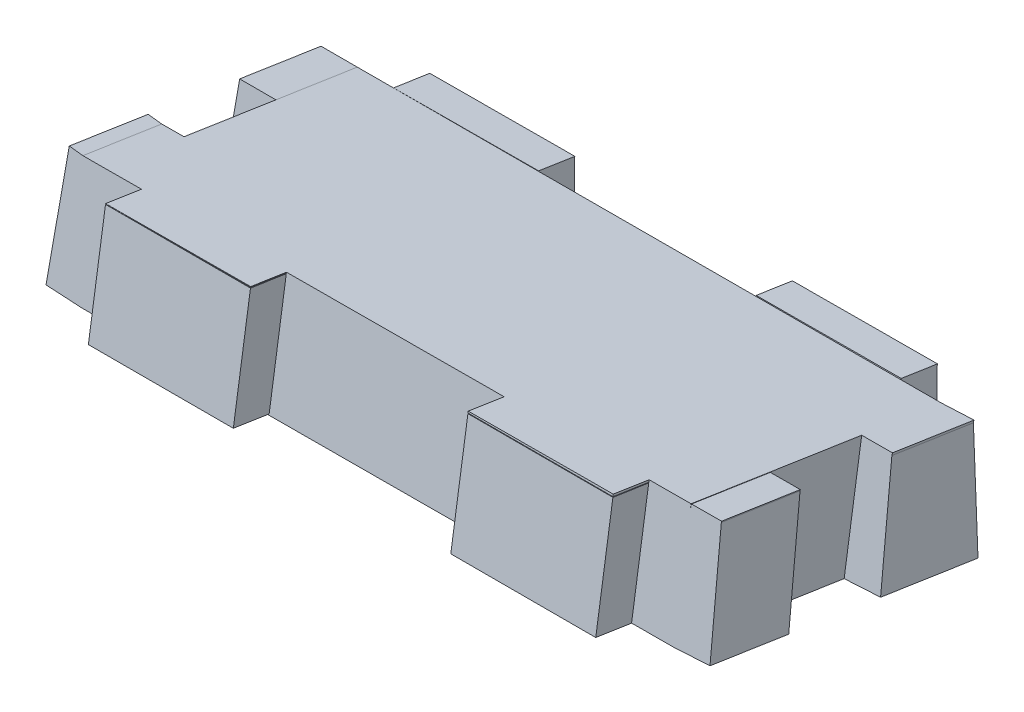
ISO-10303-21;
HEADER;
FILE_DESCRIPTION(('STEP AP214'),'2;1');
FILE_NAME('part.step','',(''),(''),'','','');
FILE_SCHEMA(('AUTOMOTIVE_DESIGN { 1 0 10303 214 1 1 1 1 }'));
ENDSEC;
DATA;
#1=APPLICATION_CONTEXT('core data for automotive mechanical design processes');
#2=APPLICATION_PROTOCOL_DEFINITION('international standard','automotive_design',2000,#1);
#3=PRODUCT_CONTEXT('',#1,'mechanical');
#4=PRODUCT('Part','Part','',(#3));
#5=PRODUCT_RELATED_PRODUCT_CATEGORY('part','',(#4));
#6=PRODUCT_DEFINITION_FORMATION('','',#4);
#7=PRODUCT_DEFINITION_CONTEXT('part definition',#1,'design');
#8=PRODUCT_DEFINITION('design','',#6,#7);
#9=PRODUCT_DEFINITION_SHAPE('','',#8);
#10=(LENGTH_UNIT() NAMED_UNIT(*) SI_UNIT(.MILLI.,.METRE.));
#11=(NAMED_UNIT(*) PLANE_ANGLE_UNIT() SI_UNIT($,.RADIAN.));
#12=(NAMED_UNIT(*) SI_UNIT($,.STERADIAN.) SOLID_ANGLE_UNIT());
#13=UNCERTAINTY_MEASURE_WITH_UNIT(LENGTH_MEASURE(1.E-05),#10,'distance_accuracy_value','');
#14=(GEOMETRIC_REPRESENTATION_CONTEXT(3) GLOBAL_UNCERTAINTY_ASSIGNED_CONTEXT((#13)) GLOBAL_UNIT_ASSIGNED_CONTEXT((#10,
#11,#12)) REPRESENTATION_CONTEXT('',''));
#15=CARTESIAN_POINT('',(0.,0.,0.));
#16=DIRECTION('',(0.,0.,1.));
#17=DIRECTION('',(1.,0.,0.));
#18=AXIS2_PLACEMENT_3D('',#15,#16,#17);
#19=CARTESIAN_POINT('',(-114.299999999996,1332.55071664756,112.229170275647));
#20=DIRECTION('',(0.,-0.150225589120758,-0.988651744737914));
#21=DIRECTION('',(0.,0.988651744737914,-0.150225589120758));
#22=AXIS2_PLACEMENT_3D('',#19,#20,#21);
#23=PLANE('',#22);
#24=DIRECTION('',(0.,0.988651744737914,-0.150225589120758));
#25=VECTOR('',#24,1.);
#26=CARTESIAN_POINT('',(-66.6749999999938,1915.85524604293,23.5960726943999));
#27=LINE('',#26,#25);
#28=CARTESIAN_POINT('',(-66.6749999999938,1915.85524604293,23.5960726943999));
#29=VERTEX_POINT('',#28);
#30=CARTESIAN_POINT('',(-66.6749999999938,1925.74176349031,22.0938168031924));
#31=VERTEX_POINT('',#30);
#32=EDGE_CURVE('E935',#29,#31,#27,.T.);
#33=ORIENTED_EDGE('',*,*,#32,.F.);
#34=DIRECTION('',(1.,0.,0.));
#35=VECTOR('',#34,1.);
#36=CARTESIAN_POINT('',(-79.3749999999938,1915.85524604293,23.5960726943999));
#37=LINE('',#36,#35);
#38=CARTESIAN_POINT('',(-79.3749999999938,1915.85524604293,23.5960726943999));
#39=VERTEX_POINT('',#38);
#40=EDGE_CURVE('E938',#39,#29,#37,.T.);
#41=ORIENTED_EDGE('',*,*,#40,.F.);
#42=DIRECTION('',(0.,-0.988651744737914,0.150225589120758));
#43=VECTOR('',#42,1.);
#44=CARTESIAN_POINT('',(-79.3749999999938,1925.74176349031,22.0938168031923));
#45=LINE('',#44,#43);
#46=CARTESIAN_POINT('',(-79.3749999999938,1925.74176349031,22.0938168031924));
#47=VERTEX_POINT('',#46);
#48=EDGE_CURVE('E955',#47,#39,#45,.T.);
#49=ORIENTED_EDGE('',*,*,#48,.F.);
#50=DIRECTION('',(-1.,0.,0.));
#51=VECTOR('',#50,1.);
#52=CARTESIAN_POINT('',(-66.6749999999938,1925.74176349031,22.0938168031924));
#53=LINE('',#52,#51);
#54=EDGE_CURVE('E939',#31,#47,#53,.T.);
#55=ORIENTED_EDGE('',*,*,#54,.F.);
#56=EDGE_LOOP('',(#33,#41,#49,#55));
#57=FACE_BOUND('',#56,.T.);
#58=DIRECTION('',(0.,-0.988651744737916,0.150225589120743));
#59=VECTOR('',#58,1.);
#60=CARTESIAN_POINT('',(-79.3749999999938,1938.89429659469,20.0952899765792));
#61=LINE('',#60,#59);
#62=CARTESIAN_POINT('',(-79.3749999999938,1925.79869455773,22.0851661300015));
#63=VERTEX_POINT('',#62);
#64=CARTESIAN_POINT('',(-79.3749999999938,1925.78665567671,22.0869954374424));
#65=VERTEX_POINT('',#64);
#66=EDGE_CURVE('E572',#63,#65,#61,.T.);
#67=ORIENTED_EDGE('',*,*,#66,.F.);
#68=DIRECTION('',(-0.999992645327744,-0.00379174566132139,0.000576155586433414));
#69=VECTOR('',#68,1.);
#70=CARTESIAN_POINT('',(-31.2481714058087,1925.98118059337,22.0574373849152));
#71=LINE('',#70,#69);
#72=CARTESIAN_POINT('',(-84.5045609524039,1925.7792444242,22.0881215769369));
#73=VERTEX_POINT('',#72);
#74=EDGE_CURVE('E559',#63,#73,#71,.T.);
#75=ORIENTED_EDGE('',*,*,#74,.T.);
#76=DIRECTION('',(-0.994862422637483,0.100087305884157,-0.0152082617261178));
#77=VECTOR('',#76,1.);
#78=CARTESIAN_POINT('',(-82.5531559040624,1925.5829249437,22.1179523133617));
#79=LINE('',#78,#77);
#80=CARTESIAN_POINT('',(-85.7118440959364,1925.90070213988,22.0696660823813));
#81=VERTEX_POINT('',#80);
#82=EDGE_CURVE('E1021',#73,#81,#79,.T.);
#83=ORIENTED_EDGE('',*,*,#82,.T.);
#84=DIRECTION('',(-0.0506832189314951,-0.987381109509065,0.150032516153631));
#85=VECTOR('',#84,1.);
#86=CARTESIAN_POINT('',(-85.7118440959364,1925.90070213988,22.0696660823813));
#87=LINE('',#86,#85);
#88=CARTESIAN_POINT('',(-86.2268321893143,1915.8680024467,23.5941343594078));
#89=VERTEX_POINT('',#88);
#90=EDGE_CURVE('E1024',#81,#89,#87,.T.);
#91=ORIENTED_EDGE('',*,*,#90,.T.);
#92=DIRECTION('',(0.998714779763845,-0.050108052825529,0.00761391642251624));
#93=VECTOR('',#92,1.);
#94=CARTESIAN_POINT('',(-86.2268321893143,1915.8680024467,23.5941343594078));
#95=LINE('',#94,#93);
#96=CARTESIAN_POINT('',(-83.0599880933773,1915.70911384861,23.618277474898));
#97=VERTEX_POINT('',#96);
#98=EDGE_CURVE('E1028',#89,#97,#95,.T.);
#99=ORIENTED_EDGE('',*,*,#98,.T.);
#100=DIRECTION('',(-0.999995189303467,-0.00306663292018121,0.000465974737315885));
#101=VECTOR('',#100,1.);
#102=CARTESIAN_POINT('',(-31.2481678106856,1915.86800244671,23.5941343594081));
#103=LINE('',#102,#101);
#104=CARTESIAN_POINT('',(-35.4078904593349,1915.85524604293,23.5960726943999));
#105=VERTEX_POINT('',#104);
#106=EDGE_CURVE('E815',#105,#97,#103,.T.);
#107=ORIENTED_EDGE('',*,*,#106,.F.);
#108=DIRECTION('',(-1.,0.,0.));
#109=VECTOR('',#108,1.);
#110=CARTESIAN_POINT('',(-34.9249999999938,1915.85524604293,23.5960726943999));
#111=LINE('',#110,#109);
#112=CARTESIAN_POINT('',(-47.6249999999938,1915.85524604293,23.5960726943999));
#113=VERTEX_POINT('',#112);
#114=EDGE_CURVE('E13',#105,#113,#111,.T.);
#115=ORIENTED_EDGE('',*,*,#114,.T.);
#116=DIRECTION('',(0.,0.988651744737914,-0.150225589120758));
#117=VECTOR('',#116,1.);
#118=CARTESIAN_POINT('',(-47.6249999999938,1915.85524604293,23.5960726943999));
#119=LINE('',#118,#117);
#120=CARTESIAN_POINT('',(-47.6249999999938,1925.74176349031,22.0938168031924));
#121=VERTEX_POINT('',#120);
#122=EDGE_CURVE('E998',#113,#121,#119,.T.);
#123=ORIENTED_EDGE('',*,*,#122,.T.);
#124=DIRECTION('',(1.,0.,0.));
#125=VECTOR('',#124,1.);
#126=CARTESIAN_POINT('',(-47.6249999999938,1925.74176349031,22.0938168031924));
#127=LINE('',#126,#125);
#128=CARTESIAN_POINT('',(-34.9249999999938,1925.74176349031,22.0938168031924));
#129=VERTEX_POINT('',#128);
#130=EDGE_CURVE('E982',#121,#129,#127,.T.);
#131=ORIENTED_EDGE('',*,*,#130,.T.);
#132=DIRECTION('',(0.,-0.988651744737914,0.150225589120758));
#133=VECTOR('',#132,1.);
#134=CARTESIAN_POINT('',(-34.9249999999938,1925.74176349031,22.0938168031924));
#135=LINE('',#134,#133);
#136=CARTESIAN_POINT('',(-34.9249999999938,1915.85672689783,23.5958476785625));
#137=VERTEX_POINT('',#136);
#138=EDGE_CURVE('E1005',#129,#137,#135,.T.);
#139=ORIENTED_EDGE('',*,*,#138,.T.);
#140=CARTESIAN_POINT('',(-31.2481678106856,1915.86800244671,23.5941343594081));
#141=VERTEX_POINT('',#140);
#142=EDGE_CURVE('E816',#141,#137,#103,.T.);
#143=ORIENTED_EDGE('',*,*,#142,.F.);
#144=DIRECTION('',(-0.998714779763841,-0.0501080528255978,0.00761391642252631));
#145=VECTOR('',#144,1.);
#146=CARTESIAN_POINT('',(-28.0813237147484,1916.0268910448,23.5699912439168));
#147=LINE('',#146,#145);
#148=CARTESIAN_POINT('',(-28.0813237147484,1916.0268910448,23.5699912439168));
#149=VERTEX_POINT('',#148);
#150=EDGE_CURVE('E698',#149,#141,#147,.T.);
#151=ORIENTED_EDGE('',*,*,#150,.F.);
#152=DIRECTION('',(-0.0506832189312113,0.98738110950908,-0.150032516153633));
#153=VECTOR('',#152,1.);
#154=CARTESIAN_POINT('',(-28.0813237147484,1916.0268910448,23.5699912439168));
#155=LINE('',#154,#153);
#156=CARTESIAN_POINT('',(-28.5881559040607,1925.90070213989,22.0696660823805));
#157=VERTEX_POINT('',#156);
#158=EDGE_CURVE('E298',#149,#157,#155,.T.);
#159=ORIENTED_EDGE('',*,*,#158,.T.);
#160=DIRECTION('',(-0.101236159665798,-0.983572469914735,0.14945379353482));
#161=VECTOR('',#160,1.);
#162=CARTESIAN_POINT('',(-27.806552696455,1933.49446507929,20.9157941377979));
#163=LINE('',#162,#161);
#164=CARTESIAN_POINT('',(-28.5788307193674,1925.99130212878,22.0558994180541));
#165=VERTEX_POINT('',#164);
#166=EDGE_CURVE('E626',#165,#157,#163,.T.);
#167=ORIENTED_EDGE('',*,*,#166,.F.);
#168=DIRECTION('',(0.999992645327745,0.0037917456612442,-0.000576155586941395));
#169=VECTOR('',#168,1.);
#170=CARTESIAN_POINT('',(-30.3818937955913,1925.9844653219,22.0569382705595));
#171=LINE('',#170,#169);
#172=CARTESIAN_POINT('',(-31.2123297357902,1925.98131649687,22.057416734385));
#173=VERTEX_POINT('',#172);
#174=EDGE_CURVE('E642',#173,#165,#171,.T.);
#175=ORIENTED_EDGE('',*,*,#174,.F.);
#176=DIRECTION('',(-0.101236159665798,-0.983572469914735,0.14945379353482));
#177=VECTOR('',#176,1.);
#178=CARTESIAN_POINT('',(-30.412044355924,1933.75658839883,20.8759645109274));
#179=LINE('',#178,#177);
#180=CARTESIAN_POINT('',(-31.2481712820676,1925.63309350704,22.1103292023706));
#181=VERTEX_POINT('',#180);
#182=EDGE_CURVE('E680',#173,#181,#179,.T.);
#183=ORIENTED_EDGE('',*,*,#182,.T.);
#184=DIRECTION('',(-3.51454771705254E-07,0.988651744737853,-0.150225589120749));
#185=VECTOR('',#184,1.);
#186=CARTESIAN_POINT('',(-31.2481678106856,1915.86800244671,23.5941343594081));
#187=LINE('',#186,#185);
#188=CARTESIAN_POINT('',(-31.2481714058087,1925.98118059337,22.0574373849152));
#189=VERTEX_POINT('',#188);
#190=EDGE_CURVE('E811',#181,#189,#187,.T.);
#191=ORIENTED_EDGE('',*,*,#190,.T.);
#192=CARTESIAN_POINT('',(-34.9249999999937,1925.96723889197,22.0595558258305));
#193=VERTEX_POINT('',#192);
#194=EDGE_CURVE('E808',#189,#193,#71,.T.);
#195=ORIENTED_EDGE('',*,*,#194,.T.);
#196=DIRECTION('',(0.,-0.988651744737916,0.150225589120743));
#197=VECTOR('',#196,1.);
#198=CARTESIAN_POINT('',(-34.9249999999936,1938.89429659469,20.0952899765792));
#199=LINE('',#198,#197);
#200=CARTESIAN_POINT('',(-34.9249999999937,1925.78665567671,22.0869954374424));
#201=VERTEX_POINT('',#200);
#202=EDGE_CURVE('E584',#193,#201,#199,.T.);
#203=ORIENTED_EDGE('',*,*,#202,.T.);
#204=DIRECTION('',(-1.,0.,0.));
#205=VECTOR('',#204,1.);
#206=CARTESIAN_POINT('',(7.12160694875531E-12,1925.78665567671,22.0869954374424));
#207=LINE('',#206,#205);
#208=CARTESIAN_POINT('',(-47.6249999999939,1925.78665567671,22.0869954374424));
#209=VERTEX_POINT('',#208);
#210=EDGE_CURVE('E581',#201,#209,#207,.T.);
#211=ORIENTED_EDGE('',*,*,#210,.T.);
#212=DIRECTION('',(0.,-0.988651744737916,0.150225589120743));
#213=VECTOR('',#212,1.);
#214=CARTESIAN_POINT('',(-47.6249999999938,1938.89429659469,20.0952899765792));
#215=LINE('',#214,#213);
#216=CARTESIAN_POINT('',(-47.6249999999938,1925.9190833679,22.0668730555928));
#217=VERTEX_POINT('',#216);
#218=EDGE_CURVE('E580',#217,#209,#215,.T.);
#219=ORIENTED_EDGE('',*,*,#218,.F.);
#220=CARTESIAN_POINT('',(-66.6749999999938,1925.8468500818,22.0778489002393));
#221=VERTEX_POINT('',#220);
#222=EDGE_CURVE('E812',#217,#221,#71,.T.);
#223=ORIENTED_EDGE('',*,*,#222,.T.);
#224=DIRECTION('',(0.,-0.988651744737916,0.150225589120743));
#225=VECTOR('',#224,1.);
#226=CARTESIAN_POINT('',(-66.6749999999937,1938.89429659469,20.0952899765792));
#227=LINE('',#226,#225);
#228=CARTESIAN_POINT('',(-66.6749999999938,1925.78665567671,22.0869954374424));
#229=VERTEX_POINT('',#228);
#230=EDGE_CURVE('E307',#221,#229,#227,.T.);
#231=ORIENTED_EDGE('',*,*,#230,.T.);
#232=DIRECTION('',(-1.,0.,0.));
#233=VECTOR('',#232,1.);
#234=CARTESIAN_POINT('',(6.59427779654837E-12,1925.78665567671,22.0869954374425));
#235=LINE('',#234,#233);
#236=EDGE_CURVE('E312',#229,#65,#235,.T.);
#237=ORIENTED_EDGE('',*,*,#236,.T.);
#238=EDGE_LOOP('',(#67,#75,#83,#91,#99,#107,#115,#123,#131,#139,#143,#151,#159,#167,#175,#183,
#191,#195,#203,#211,#219,#223,#231,#237));
#239=FACE_BOUND('',#238,.T.);
#240=ADVANCED_FACE('F288',(#57,#239),#23,.F.);
#241=CARTESIAN_POINT('',(-82.5499999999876,1922.43053769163,-1.06852704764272E-13));
#242=DIRECTION('',(-0.998750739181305,0.0494025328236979,-0.00750671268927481));
#243=DIRECTION('',(-0.0494039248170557,-0.998778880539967,0.));
#244=AXIS2_PLACEMENT_3D('',#241,#242,#243);
#245=PLANE('',#244);
#246=DIRECTION('',(0.0499696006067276,0.98741666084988,-0.150037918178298));
#247=VECTOR('',#246,1.);
#248=CARTESIAN_POINT('',(-82.5499999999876,1924.73684135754,15.1780476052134));
#249=LINE('',#248,#247);
#250=CARTESIAN_POINT('',(-83.0599880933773,1914.65929952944,16.7093296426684));
#251=VERTEX_POINT('',#250);
#252=CARTESIAN_POINT('',(-82.5499999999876,1924.73684135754,15.1780476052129));
#253=VERTEX_POINT('',#252);
#254=EDGE_CURVE('E1032',#251,#253,#249,.T.);
#255=ORIENTED_EDGE('',*,*,#254,.T.);
#256=DIRECTION('',(0.,0.150225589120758,0.988651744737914));
#257=VECTOR('',#256,1.);
#258=CARTESIAN_POINT('',(-82.5499999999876,1922.43053769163,-1.06852704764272E-13));
#259=LINE('',#258,#257);
#260=CARTESIAN_POINT('',(-82.5499999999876,1923.5140050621,7.13042240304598));
#261=VERTEX_POINT('',#260);
#262=EDGE_CURVE('E1357',#261,#253,#259,.T.);
#263=ORIENTED_EDGE('',*,*,#262,.F.);
#264=DIRECTION('',(-0.0499696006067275,-0.987416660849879,0.150037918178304));
#265=VECTOR('',#264,1.);
#266=CARTESIAN_POINT('',(-82.5499999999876,1923.5140050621,7.13042240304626));
#267=LINE('',#266,#265);
#268=CARTESIAN_POINT('',(-83.0599880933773,1913.43646323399,8.66170444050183));
#269=VERTEX_POINT('',#268);
#270=EDGE_CURVE('E1053',#261,#269,#267,.T.);
#271=ORIENTED_EDGE('',*,*,#270,.T.);
#272=DIRECTION('',(0.,0.150225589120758,0.988651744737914));
#273=VECTOR('',#272,1.);
#274=CARTESIAN_POINT('',(-83.0599880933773,1912.13779867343,0.11504477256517));
#275=LINE('',#274,#273);
#276=EDGE_CURVE('E730',#269,#251,#275,.T.);
#277=ORIENTED_EDGE('',*,*,#276,.T.);
#278=EDGE_LOOP('',(#255,#263,#271,#277));
#279=FACE_BOUND('',#278,.T.);
#280=ADVANCED_FACE('F773',(#279),#245,.T.);
#281=CARTESIAN_POINT('',(-28.0813237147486,1912.45924954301,0.0909354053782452));
#282=DIRECTION('',(0.998751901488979,0.0493795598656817,-0.007503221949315));
#283=DIRECTION('',(-0.049380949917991,0.998780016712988,0.));
#284=AXIS2_PLACEMENT_3D('',#281,#282,#283);
#285=PLANE('',#284);
#286=CARTESIAN_POINT('',(-28.5749921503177,1922.43053935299,0.000328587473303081));
#287=CARTESIAN_POINT('',(-28.5544235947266,1922.0150685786,0.00406324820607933));
#288=CARTESIAN_POINT('',(-28.533854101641,1921.59959821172,0.00783757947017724));
#289=CARTESIAN_POINT('',(-28.4927145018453,1920.76865760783,0.0154119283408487));
#290=CARTESIAN_POINT('',(-28.472144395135,1920.35318737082,0.0192119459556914));
#291=CARTESIAN_POINT('',(-28.4310048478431,1919.5222467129,0.0267840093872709));
#292=CARTESIAN_POINT('',(-28.4104354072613,1919.106776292,0.0305560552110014));
#293=CARTESIAN_POINT('',(-28.3692973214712,1918.27583526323,0.0380668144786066));
#294=CARTESIAN_POINT('',(-28.3487286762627,1917.86036465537,0.0418055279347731));
#295=CARTESIAN_POINT('',(-28.3075917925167,1917.02942334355,0.0492659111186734));
#296=CARTESIAN_POINT('',(-28.2870235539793,1916.6139526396,0.0529875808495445));
#297=CARTESIAN_POINT('',(-28.2458868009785,1915.78301128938,0.0604424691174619));
#298=CARTESIAN_POINT('',(-28.225318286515,1915.36754064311,0.0641756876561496));
#299=CARTESIAN_POINT('',(-28.1841802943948,1914.53659957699,0.0716824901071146));
#300=CARTESIAN_POINT('',(-28.1636108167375,1914.12112915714,0.0754560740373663));
#301=CARTESIAN_POINT('',(-28.1224708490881,1913.29018853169,0.0830456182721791));
#302=CARTESIAN_POINT('',(-28.1019003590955,1912.87471832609,0.0868615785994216));
#303=CARTESIAN_POINT('',(-28.0813293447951,1912.45924835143,0.0906997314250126));
#304=B_SPLINE_CURVE_WITH_KNOTS('',3,(#286,#287,#288,#289,#290,#291,#292,#293,#294,#295,#296,
#297,#298,#299,#300,#301,#302,#303),.UNSPECIFIED.,.F.,.F.,(4,2,2,2,2,2,2,2,4),(0.,
1.24798909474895,2.49597859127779,3.74396777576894,4.99195650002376,6.23994499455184,
7.48793366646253,8.73592289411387,9.98391278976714),.UNSPECIFIED.);
#305=CARTESIAN_POINT('',(-28.0813265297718,1912.45924894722,0.0908175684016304));
#306=VERTEX_POINT('',#305);
#307=CARTESIAN_POINT('',(-28.5750569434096,1922.42994715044,0.000254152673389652));
#308=VERTEX_POINT('',#307);
#309=EDGE_CURVE('E794',#306,#308,#304,.F.);
#310=ORIENTED_EDGE('',*,*,#309,.T.);
#311=CARTESIAN_POINT('',(-28.5749999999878,1923.51584160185,7.14250888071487));
#312=DIRECTION('',(8.72806232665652E-07,-0.150225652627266,-0.988651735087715));
#313=VECTOR('',#312,1.);
#314=LINE('',#311,#313);
#315=CARTESIAN_POINT('',(-28.5749999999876,1923.51584160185,7.14250888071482));
#316=VERTEX_POINT('',#315);
#317=EDGE_CURVE('E619',#316,#308,#314,.T.);
#318=ORIENTED_EDGE('',*,*,#317,.F.);
#319=DIRECTION('',(0.0499463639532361,-0.987417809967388,0.150038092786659));
#320=VECTOR('',#319,1.);
#321=CARTESIAN_POINT('',(-28.0813237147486,1913.75607696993,8.62550468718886));
#322=LINE('',#321,#320);
#323=CARTESIAN_POINT('',(-28.0813237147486,1913.75607696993,8.62550468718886));
#324=VERTEX_POINT('',#323);
#325=EDGE_CURVE('E761',#316,#324,#322,.T.);
#326=ORIENTED_EDGE('',*,*,#325,.T.);
#327=DIRECTION('',(0.,0.150225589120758,0.988651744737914));
#328=VECTOR('',#327,1.);
#329=CARTESIAN_POINT('',(-28.0813237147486,1912.45924954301,0.0909354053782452));
#330=LINE('',#329,#328);
#331=EDGE_CURVE('E729',#306,#324,#330,.T.);
#332=ORIENTED_EDGE('',*,*,#331,.F.);
#333=EDGE_LOOP('',(#310,#318,#326,#332));
#334=FACE_BOUND('',#333,.T.);
#335=ADVANCED_FACE('F763',(#334),#285,.T.);
#336=CARTESIAN_POINT('',(1.36763839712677E-12,45.6930289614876,300.711037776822));
#337=DIRECTION('',(0.,0.150225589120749,0.988651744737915));
#338=DIRECTION('',(0.,-0.988651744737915,0.150225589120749));
#339=AXIS2_PLACEMENT_3D('',#336,#337,#338);
#340=PLANE('',#339);
#341=DIRECTION('',(-3.51454771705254E-07,0.988651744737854,-0.15022558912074));
#342=VECTOR('',#341,1.);
#343=CARTESIAN_POINT('',(-31.2475033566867,45.693018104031,300.711039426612));
#344=LINE('',#343,#342);
#345=CARTESIAN_POINT('',(-31.2481678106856,1914.82002466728,16.6972730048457));
#346=VERTEX_POINT('',#345);
#347=CARTESIAN_POINT('',(-31.2481712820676,1924.58511572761,15.2134678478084));
#348=VERTEX_POINT('',#347);
#349=EDGE_CURVE('E1284',#346,#348,#344,.T.);
#350=ORIENTED_EDGE('',*,*,#349,.T.);
#351=DIRECTION('',(-0.101236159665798,-0.983572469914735,0.14945379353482));
#352=VECTOR('',#351,1.);
#353=CARTESIAN_POINT('',(-30.412044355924,1932.7086106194,13.979103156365));
#354=LINE('',#353,#352);
#355=CARTESIAN_POINT('',(-31.2123297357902,1924.93333871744,15.1605553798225));
#356=VERTEX_POINT('',#355);
#357=EDGE_CURVE('E633',#356,#348,#354,.T.);
#358=ORIENTED_EDGE('',*,*,#357,.F.);
#359=DIRECTION('',(-0.999992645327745,-0.00379174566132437,0.000576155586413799));
#360=VECTOR('',#359,1.);
#361=CARTESIAN_POINT('',(-27.7774573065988,1924.94636297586,15.1585763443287));
#362=LINE('',#361,#360);
#363=CARTESIAN_POINT('',(-28.5788307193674,1924.94332434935,15.159038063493));
#364=VERTEX_POINT('',#363);
#365=EDGE_CURVE('E670',#364,#356,#362,.T.);
#366=ORIENTED_EDGE('',*,*,#365,.F.);
#367=DIRECTION('',(-0.101236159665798,-0.983572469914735,0.14945379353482));
#368=VECTOR('',#367,1.);
#369=CARTESIAN_POINT('',(-27.806552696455,1932.44648729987,14.0189327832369));
#370=LINE('',#369,#368);
#371=CARTESIAN_POINT('',(-28.5881559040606,1924.85272436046,15.1728047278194));
#372=VERTEX_POINT('',#371);
#373=EDGE_CURVE('E623',#364,#372,#370,.T.);
#374=ORIENTED_EDGE('',*,*,#373,.T.);
#375=DIRECTION('',(-0.0506832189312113,0.987381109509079,-0.150032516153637));
#376=VECTOR('',#375,1.);
#377=CARTESIAN_POINT('',(-28.0813237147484,1914.97891326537,16.6731298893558));
#378=LINE('',#377,#376);
#379=CARTESIAN_POINT('',(-28.0813237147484,1914.97891326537,16.6731298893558));
#380=VERTEX_POINT('',#379);
#381=EDGE_CURVE('E706',#380,#372,#378,.T.);
#382=ORIENTED_EDGE('',*,*,#381,.F.);
#383=DIRECTION('',(-0.998714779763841,-0.0501080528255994,0.00761391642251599));
#384=VECTOR('',#383,1.);
#385=CARTESIAN_POINT('',(-28.0813237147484,1914.97891326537,16.6731298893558));
#386=LINE('',#385,#384);
#387=EDGE_CURVE('E713',#380,#346,#386,.T.);
#388=ORIENTED_EDGE('',*,*,#387,.T.);
#389=EDGE_LOOP('',(#350,#358,#366,#374,#382,#388));
#390=FACE_BOUND('',#389,.T.);
#391=ADVANCED_FACE('F290',(#390),#340,.F.);
#392=CARTESIAN_POINT('',(-28.0813237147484,1914.97891326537,16.6731298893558));
#393=DIRECTION('',(-0.0506832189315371,0.987381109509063,-0.150032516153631));
#394=DIRECTION('',(0.,0.150225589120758,0.988651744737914));
#395=AXIS2_PLACEMENT_3D('',#392,#393,#394);
#396=PLANE('',#395);
#397=DIRECTION('',(0.,0.150225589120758,0.988651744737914));
#398=VECTOR('',#397,1.);
#399=CARTESIAN_POINT('',(-28.0813237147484,1914.97891326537,16.6731298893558));
#400=LINE('',#399,#398);
#401=EDGE_CURVE('E715',#380,#149,#400,.T.);
#402=ORIENTED_EDGE('',*,*,#401,.T.);
#403=ORIENTED_EDGE('',*,*,#150,.T.);
#404=DIRECTION('',(0.,0.150225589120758,0.988651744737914));
#405=VECTOR('',#404,1.);
#406=CARTESIAN_POINT('',(-31.2481678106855,1914.82002466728,16.697273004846));
#407=LINE('',#406,#405);
#408=EDGE_CURVE('E708',#346,#141,#407,.T.);
#409=ORIENTED_EDGE('',*,*,#408,.F.);
#410=ORIENTED_EDGE('',*,*,#387,.F.);
#411=EDGE_LOOP('',(#402,#403,#409,#410));
#412=FACE_BOUND('',#411,.T.);
#413=ADVANCED_FACE('F1309',(#412),#396,.F.);
#414=CARTESIAN_POINT('',(-28.0813237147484,1914.97891326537,16.6731298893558));
#415=DIRECTION('',(0.998714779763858,0.0501080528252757,-0.00761391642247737));
#416=DIRECTION('',(-0.0501095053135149,0.998743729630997,0.));
#417=AXIS2_PLACEMENT_3D('',#414,#415,#416);
#418=PLANE('',#417);
#419=ORIENTED_EDGE('',*,*,#158,.F.);
#420=ORIENTED_EDGE('',*,*,#401,.F.);
#421=ORIENTED_EDGE('',*,*,#381,.T.);
#422=DIRECTION('',(0.,0.150225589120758,0.988651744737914));
#423=VECTOR('',#422,1.);
#424=CARTESIAN_POINT('',(-28.5881559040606,1924.85272436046,15.1728047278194));
#425=LINE('',#424,#423);
#426=EDGE_CURVE('E694',#372,#157,#425,.T.);
#427=ORIENTED_EDGE('',*,*,#426,.T.);
#428=EDGE_LOOP('',(#419,#420,#421,#427));
#429=FACE_BOUND('',#428,.T.);
#430=ADVANCED_FACE('F705',(#429),#418,.T.);
#431=CARTESIAN_POINT('',(-31.2481678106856,1912.30036094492,0.11507852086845));
#432=DIRECTION('',(0.999999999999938,3.47466373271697E-07,-5.27974999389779E-08));
#433=DIRECTION('',(-3.47466373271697E-07,0.99999999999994,0.));
#434=AXIS2_PLACEMENT_3D('',#431,#432,#433);
#435=PLANE('',#434);
#436=DIRECTION('',(1.60567958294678E-12,-0.988651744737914,0.150225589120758));
#437=VECTOR('',#436,1.);
#438=CARTESIAN_POINT('',(-31.2481678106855,1913.59718837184,8.64964780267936));
#439=LINE('',#438,#437);
#440=CARTESIAN_POINT('',(-31.2481688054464,1923.71033828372,7.11295511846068));
#441=VERTEX_POINT('',#440);
#442=CARTESIAN_POINT('',(-31.2481678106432,1913.59718837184,8.64964780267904));
#443=VERTEX_POINT('',#442);
#444=EDGE_CURVE('E1054',#441,#443,#439,.T.);
#445=ORIENTED_EDGE('',*,*,#444,.F.);
#446=DIRECTION('',(0.,0.150225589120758,0.988651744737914));
#447=VECTOR('',#446,1.);
#448=CARTESIAN_POINT('',(-31.2481714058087,1922.64701726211,0.114928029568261));
#449=LINE('',#448,#447);
#450=EDGE_CURVE('E743',#441,#189,#449,.T.);
#451=ORIENTED_EDGE('',*,*,#450,.T.);
#452=ORIENTED_EDGE('',*,*,#190,.F.);
#453=DIRECTION('',(0.,-0.150225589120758,-0.988651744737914));
#454=VECTOR('',#453,1.);
#455=CARTESIAN_POINT('',(-31.2481712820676,1924.58511572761,15.2134678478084));
#456=LINE('',#455,#454);
#457=EDGE_CURVE('E820',#181,#348,#456,.T.);
#458=ORIENTED_EDGE('',*,*,#457,.T.);
#459=ORIENTED_EDGE('',*,*,#349,.F.);
#460=DIRECTION('',(0.,0.150225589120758,0.988651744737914));
#461=VECTOR('',#460,1.);
#462=CARTESIAN_POINT('',(-31.2481678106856,1912.30036094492,0.11507852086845));
#463=LINE('',#462,#461);
#464=EDGE_CURVE('E724',#443,#346,#463,.T.);
#465=ORIENTED_EDGE('',*,*,#464,.F.);
#466=EDGE_LOOP('',(#445,#451,#452,#458,#459,#465));
#467=FACE_BOUND('',#466,.T.);
#468=ADVANCED_FACE('F847',(#467),#435,.T.);
#469=CARTESIAN_POINT('',(-83.6289753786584,1922.52908109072,-0.0032865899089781));
#470=CARTESIAN_POINT('',(-83.6187146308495,1920.41179343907,0.0209185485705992));
#471=CARTESIAN_POINT('',(-83.6084537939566,1918.29450534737,0.0450452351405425));
#472=CARTESIAN_POINT('',(-83.5981928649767,1916.17721680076,0.0690908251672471));
#473=CARTESIAN_POINT('',(-83.5879318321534,1914.05992774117,0.0930449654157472));
#474=CARTESIAN_POINT('',(-83.5776707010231,1911.94263819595,0.116912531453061));
#475=CARTESIAN_POINT('',(-73.0492246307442,1922.58055494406,0.0206345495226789));
#476=CARTESIAN_POINT('',(-73.038958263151,1920.46323953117,0.0398906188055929));
#477=CARTESIAN_POINT('',(-73.028691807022,1918.34592368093,0.059068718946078));
#478=CARTESIAN_POINT('',(-73.0184252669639,1916.22860741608,0.0781729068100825));
#479=CARTESIAN_POINT('',(-73.0081586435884,1914.11129073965,0.0972037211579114));
#480=CARTESIAN_POINT('',(-72.9978919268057,1911.99397360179,0.116152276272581));
#481=CARTESIAN_POINT('',(-62.4694742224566,1922.63203047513,0.0448547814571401));
#482=CARTESIAN_POINT('',(-62.4592021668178,1920.51468696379,0.0591016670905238));
#483=CARTESIAN_POINT('',(-62.4489300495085,1918.39734314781,0.0732942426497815));
#484=CARTESIAN_POINT('',(-62.4386578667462,1916.27999900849,0.0874291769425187));
#485=CARTESIAN_POINT('',(-62.4283856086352,1914.16265449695,0.101497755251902));
#486=CARTESIAN_POINT('',(-62.4181132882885,1912.04530967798,0.115511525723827));
#487=CARTESIAN_POINT('',(-51.8897220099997,1922.68349709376,0.0674861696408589));
#488=CARTESIAN_POINT('',(-51.8794449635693,1920.56612892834,0.077337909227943));
#489=CARTESIAN_POINT('',(-51.8691678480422,1918.4487604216,0.0871287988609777));
#490=CARTESIAN_POINT('',(-51.8588906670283,1916.33139159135,0.0968620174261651));
#491=CARTESIAN_POINT('',(-51.8486134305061,1914.2140224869,0.106546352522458));
#492=CARTESIAN_POINT('',(-51.8383361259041,1912.09665304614,0.116170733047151));
#493=CARTESIAN_POINT('',(-41.3099715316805,1922.73497227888,0.0916447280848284));
#494=CARTESIAN_POINT('',(-41.2996888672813,1920.61757636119,0.0965489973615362));
#495=CARTESIAN_POINT('',(-41.2894061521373,1918.50018019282,0.101408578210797));
#496=CARTESIAN_POINT('',(-41.279123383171,1916.38278375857,0.106220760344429));
#497=CARTESIAN_POINT('',(-41.2688405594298,1914.26538705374,0.110984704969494));
#498=CARTESIAN_POINT('',(-41.2585576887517,1912.14799011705,0.115707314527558));
#499=CARTESIAN_POINT('',(-30.7302210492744,1922.78644744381,0.115799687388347));
#500=CARTESIAN_POINT('',(-30.719932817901,1920.66902402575,0.115801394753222));
#501=CARTESIAN_POINT('',(-30.7096445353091,1918.55160035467,0.115757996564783));
#502=CARTESIAN_POINT('',(-30.6993562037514,1916.43417644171,0.115671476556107));
#503=CARTESIAN_POINT('',(-30.6890678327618,1914.31675233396,0.115550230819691));
#504=CARTESIAN_POINT('',(-30.6787794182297,1912.19932801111,0.11539063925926));
#505=B_SPLINE_SURFACE_WITH_KNOTS('',5,5,((#469,#470,#471,#472,#473,#474),(#475,#476,#477,#478,
#479,#480),(#481,#482,#483,#484,#485,#486),(#487,#488,#489,#490,#491,#492),(#493,#494,#495,#496,
#497,#498),(#499,#500,#501,#502,#503,#504)),.UNSPECIFIED.,.F.,.F.,.F.,(6,6),(6,6),
(-26.5771389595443,26.3223409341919),(-5.2796012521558,5.30747397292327),.UNSPECIFIED.);
#506=CARTESIAN_POINT('',(-31.2481643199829,1912.30036168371,0.115224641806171));
#507=CARTESIAN_POINT('',(-31.2481621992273,1912.73147266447,0.115313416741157));
#508=CARTESIAN_POINT('',(-31.2481609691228,1913.16258365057,0.115364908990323));
#509=CARTESIAN_POINT('',(-31.2481599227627,1914.02480532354,0.115408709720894));
#510=CARTESIAN_POINT('',(-31.2481601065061,1914.45591601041,0.115401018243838));
#511=CARTESIAN_POINT('',(-31.2481615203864,1915.31813717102,0.115341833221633));
#512=CARTESIAN_POINT('',(-31.2481627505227,1915.74924764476,0.115290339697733));
#513=CARTESIAN_POINT('',(-31.248165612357,1916.61146850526,0.115170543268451));
#514=CARTESIAN_POINT('',(-31.2481672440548,1917.04257889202,0.115102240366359));
#515=CARTESIAN_POINT('',(-31.248170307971,1917.90479970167,0.11497398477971));
#516=CARTESIAN_POINT('',(-31.2481717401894,1918.33591012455,0.114914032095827));
#517=CARTESIAN_POINT('',(-31.2481739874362,1919.19813109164,0.114819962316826));
#518=CARTESIAN_POINT('',(-31.2481748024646,1919.62924163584,0.11478584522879));
#519=CARTESIAN_POINT('',(-31.248175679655,1920.49146286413,0.114749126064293));
#520=CARTESIAN_POINT('',(-31.2481757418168,1920.92257354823,0.114746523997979));
#521=CARTESIAN_POINT('',(-31.2481755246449,1921.7847949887,0.11475561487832));
#522=CARTESIAN_POINT('',(-31.2481752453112,1922.21590574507,0.114767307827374));
#523=CARTESIAN_POINT('',(-31.2481750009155,1922.64701650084,0.114777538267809));
#524=B_SPLINE_CURVE_WITH_KNOTS('',3,(#506,#507,#508,#509,#510,#511,#512,#513,#514,#515,#516,
#517,#518,#519,#520,#521,#522,#523),.UNSPECIFIED.,.F.,.F.,(4,2,2,2,2,2,2,2,4),(0.,
1.29333296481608,2.5866650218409,3.87999645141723,5.17332762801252,6.46665890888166,
7.75999054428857,9.05332259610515,10.3466548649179),.UNSPECIFIED.);
#525=CARTESIAN_POINT('',(-31.2481679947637,1912.30036185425,0.115240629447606));
#526=VERTEX_POINT('',#525);
#527=CARTESIAN_POINT('',(-31.2481713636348,1922.64676350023,0.114890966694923));
#528=VERTEX_POINT('',#527);
#529=EDGE_CURVE('E828',#526,#528,#524,.T.);
#530=CARTESIAN_POINT('',(-31.2481681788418,1912.30036276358,0.115402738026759));
#531=CARTESIAN_POINT('',(-33.4069940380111,1912.29358946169,0.11542380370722));
#532=CARTESIAN_POINT('',(-35.5658198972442,1912.28681611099,0.115436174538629));
#533=CARTESIAN_POINT('',(-39.8834715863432,1912.27326926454,0.115435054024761));
#534=CARTESIAN_POINT('',(-42.0422974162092,1912.26649576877,0.11542156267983));
#535=CARTESIAN_POINT('',(-46.3599490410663,1912.25294858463,0.115360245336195));
#536=CARTESIAN_POINT('',(-48.5187748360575,1912.24617489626,0.115312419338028));
#537=CARTESIAN_POINT('',(-52.8364264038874,1912.23262740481,0.115196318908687));
#538=CARTESIAN_POINT('',(-54.9952521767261,1912.22585360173,0.115128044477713));
#539=CARTESIAN_POINT('',(-59.312903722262,1912.21230599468,0.114991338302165));
#540=CARTESIAN_POINT('',(-61.4717294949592,1912.20553219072,0.114922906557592));
#541=CARTESIAN_POINT('',(-65.7893810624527,1912.1919846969,0.114806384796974));
#542=CARTESIAN_POINT('',(-67.948206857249,1912.18521100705,0.114758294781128));
#543=CARTESIAN_POINT('',(-72.2658584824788,1912.17166382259,0.11469692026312));
#544=CARTESIAN_POINT('',(-74.4246843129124,1912.16489032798,0.114683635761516));
#545=CARTESIAN_POINT('',(-78.7423360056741,1912.15134349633,0.114685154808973));
#546=CARTESIAN_POINT('',(-80.9011618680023,1912.14457015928,0.114699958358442));
#547=CARTESIAN_POINT('',(-83.0599877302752,1912.13779688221,0.114725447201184));
#548=B_SPLINE_CURVE_WITH_KNOTS('',3,(#530,#531,#532,#533,#534,#535,#536,#537,#538,#539,#540,
#541,#542,#543,#544,#545,#546,#547),.UNSPECIFIED.,.F.,.F.,(4,2,2,2,2,2,2,2,4),(0.,
6.47650945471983,12.9530188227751,19.4295280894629,25.9060372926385,32.3825464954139,
38.8590557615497,45.3355651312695,51.8120745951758),.UNSPECIFIED.);
#549=CARTESIAN_POINT('',(-83.0599878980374,1912.13779791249,0.114932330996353));
#550=VERTEX_POINT('',#549);
#551=EDGE_CURVE('E1388',#526,#550,#548,.T.);
#552=CARTESIAN_POINT('',(-82.550000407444,1922.43053886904,0.000114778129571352));
#553=CARTESIAN_POINT('',(-82.5712499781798,1922.00167494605,0.00492725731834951));
#554=CARTESIAN_POINT('',(-82.5924995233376,1921.57281093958,0.00973241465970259));
#555=CARTESIAN_POINT('',(-82.6349985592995,1920.71508276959,0.0193274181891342));
#556=CARTESIAN_POINT('',(-82.6562480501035,1920.28621860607,0.0241172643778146));
#557=CARTESIAN_POINT('',(-82.6987469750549,1919.42849011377,0.0336809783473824));
#558=CARTESIAN_POINT('',(-82.7199964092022,1918.99962578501,0.0384548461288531));
#559=CARTESIAN_POINT('',(-82.7624952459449,1918.141897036,0.0479936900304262));
#560=CARTESIAN_POINT('',(-82.7837446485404,1917.71303261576,0.0527586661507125));
#561=CARTESIAN_POINT('',(-82.8262434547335,1916.85530377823,0.0622889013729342));
#562=CARTESIAN_POINT('',(-82.8474928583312,1916.42643936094,0.0670541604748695));
#563=CARTESIAN_POINT('',(-82.8899916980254,1915.56871062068,0.0765938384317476));
#564=CARTESIAN_POINT('',(-82.911241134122,1915.13984629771,0.081368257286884));
#565=CARTESIAN_POINT('',(-82.9537400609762,1914.28211781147,0.0909325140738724));
#566=CARTESIAN_POINT('',(-82.9749895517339,1913.8532536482,0.0957223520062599));
#567=CARTESIAN_POINT('',(-83.0174885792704,1912.99552545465,0.105314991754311));
#568=CARTESIAN_POINT('',(-83.0387381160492,1912.56666142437,0.110117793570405));
#569=CARTESIAN_POINT('',(-83.0599876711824,1912.137797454,0.114925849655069));
#570=B_SPLINE_CURVE_WITH_KNOTS('',3,(#552,#553,#554,#555,#556,#557,#558,#559,#560,#561,#562,
#563,#564,#565,#566,#567,#568,#569),.UNSPECIFIED.,.F.,.F.,(4,2,2,2,2,2,2,2,4),(0.,
1.28825103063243,2.57650201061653,3.86475294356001,5.15300384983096,6.44125475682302,
7.72950569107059,9.01775667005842,10.3060076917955),.UNSPECIFIED.);
#571=CARTESIAN_POINT('',(-82.5500001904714,1922.43053843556,0.000110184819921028));
#572=VERTEX_POINT('',#571);
#573=EDGE_CURVE('E748',#572,#550,#570,.T.);
#574=CARTESIAN_POINT('',(-82.5500003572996,1922.43053945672,0.000314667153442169));
#575=CARTESIAN_POINT('',(-80.4124241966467,1922.43955955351,0.00512378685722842));
#576=CARTESIAN_POINT('',(-78.2748480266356,1922.44857962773,0.0099288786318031));
#577=CARTESIAN_POINT('',(-73.9996956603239,1922.46661964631,0.0195159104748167));
#578=CARTESIAN_POINT('',(-71.8621194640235,1922.47563959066,0.0242978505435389));
#579=CARTESIAN_POINT('',(-67.5869670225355,1922.49367926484,0.0338234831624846));
#580=CARTESIAN_POINT('',(-65.449390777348,1922.50269899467,0.0385671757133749));
#581=CARTESIAN_POINT('',(-61.1742382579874,1922.52073831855,0.0480303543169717));
#582=CARTESIAN_POINT('',(-59.0366619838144,1922.52975791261,0.0527498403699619));
#583=CARTESIAN_POINT('',(-54.7615094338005,1922.5477970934,0.0621875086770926));
#584=CARTESIAN_POINT('',(-52.6239331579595,1922.55681668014,0.0669056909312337));
#585=CARTESIAN_POINT('',(-48.34878063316,1922.57485598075,0.0763647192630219));
#586=CARTESIAN_POINT('',(-46.2112043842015,1922.58387569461,0.0811055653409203));
#587=CARTESIAN_POINT('',(-41.9360519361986,1922.60191534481,0.0906269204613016));
#588=CARTESIAN_POINT('',(-39.7984757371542,1922.61093528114,0.0954074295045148));
#589=CARTESIAN_POINT('',(-35.5233233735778,1922.62897532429,0.104998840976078));
#590=CARTESIAN_POINT('',(-33.3857472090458,1922.6379954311,0.109809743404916));
#591=CARTESIAN_POINT('',(-31.2481710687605,1922.64701559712,0.11463120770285));
#592=B_SPLINE_CURVE_WITH_KNOTS('',3,(#574,#575,#576,#577,#578,#579,#580,#581,#582,#583,#584,
#585,#586,#587,#588,#589,#590,#591),.UNSPECIFIED.,.F.,.F.,(4,2,2,2,2,2,2,2,4),(0.,
6.41280180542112,12.8256035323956,19.2384051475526,25.6512066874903,32.0640082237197,
38.4768098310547,44.8896115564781,51.3024133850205),.UNSPECIFIED.);
#593=EDGE_CURVE('E747',#528,#572,#592,.F.);
#594=ORIENTED_EDGE('',*,*,#529,.F.);
#595=ORIENTED_EDGE('',*,*,#551,.T.);
#596=ORIENTED_EDGE('',*,*,#573,.F.);
#597=ORIENTED_EDGE('',*,*,#593,.F.);
#598=EDGE_LOOP('',(#594,#595,#596,#597));
#599=FACE_BOUND('',#598,.T.);
#600=ADVANCED_FACE('F834',(#599),#505,.T.);
#601=CARTESIAN_POINT('',(-31.2481678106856,1912.30036094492,0.11507852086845));
#602=DIRECTION('',(-0.00310183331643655,0.988646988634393,-0.150224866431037));
#603=DIRECTION('',(0.,0.150225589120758,0.988651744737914));
#604=AXIS2_PLACEMENT_3D('',#601,#602,#603);
#605=PLANE('',#604);
#606=EDGE_CURVE('E728',#526,#443,#463,.T.);
#607=ORIENTED_EDGE('',*,*,#606,.T.);
#608=ORIENTED_EDGE('',*,*,#464,.T.);
#609=ORIENTED_EDGE('',*,*,#408,.T.);
#610=ORIENTED_EDGE('',*,*,#142,.T.);
#611=EDGE_CURVE('E821',#137,#105,#103,.T.);
#612=ORIENTED_EDGE('',*,*,#611,.T.);
#613=ORIENTED_EDGE('',*,*,#106,.T.);
#614=DIRECTION('',(0.,0.150225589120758,0.988651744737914));
#615=VECTOR('',#614,1.);
#616=CARTESIAN_POINT('',(-83.0599880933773,1914.65929952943,16.7093296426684));
#617=LINE('',#616,#615);
#618=EDGE_CURVE('E1033',#251,#97,#617,.T.);
#619=ORIENTED_EDGE('',*,*,#618,.F.);
#620=ORIENTED_EDGE('',*,*,#276,.F.);
#621=EDGE_CURVE('E1359',#550,#269,#275,.T.);
#622=ORIENTED_EDGE('',*,*,#621,.F.);
#623=ORIENTED_EDGE('',*,*,#551,.F.);
#624=EDGE_LOOP('',(#607,#608,#609,#610,#612,#613,#619,#620,#622,#623));
#625=FACE_BOUND('',#624,.T.);
#626=ADVANCED_FACE('F846',(#625),#605,.F.);
#627=CARTESIAN_POINT('',(-31.2481714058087,1922.64701726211,0.114928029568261));
#628=DIRECTION('',(-0.00383526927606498,0.988644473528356,-0.150224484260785));
#629=DIRECTION('',(0.,0.150225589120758,0.988651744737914));
#630=AXIS2_PLACEMENT_3D('',#627,#628,#629);
#631=PLANE('',#630);
#632=DIRECTION('',(0.,0.150225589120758,0.988651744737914));
#633=VECTOR('',#632,1.);
#634=CARTESIAN_POINT('',(-84.5045609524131,1879.03823768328,-285.519777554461));
#635=LINE('',#634,#633);
#636=CARTESIAN_POINT('',(-84.5045609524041,1924.72943010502,15.1791737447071));
#637=VERTEX_POINT('',#636);
#638=EDGE_CURVE('E616',#637,#73,#635,.T.);
#639=ORIENTED_EDGE('',*,*,#638,.T.);
#640=ORIENTED_EDGE('',*,*,#74,.F.);
#641=DIRECTION('',(0.,0.150225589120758,0.988651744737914));
#642=VECTOR('',#641,1.);
#643=CARTESIAN_POINT('',(-79.3749999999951,1879.05768781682,-285.522733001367));
#644=LINE('',#643,#642);
#645=CARTESIAN_POINT('',(-79.3749999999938,1926.27566080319,25.2241354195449));
#646=VERTEX_POINT('',#645);
#647=EDGE_CURVE('E546',#63,#646,#644,.T.);
#648=ORIENTED_EDGE('',*,*,#647,.T.);
#649=DIRECTION('',(0.999992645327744,0.00379174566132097,-0.000576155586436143));
#650=VECTOR('',#649,1.);
#651=CARTESIAN_POINT('',(0.0496337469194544,1926.57682102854,25.1783741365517));
#652=LINE('',#651,#650);
#653=CARTESIAN_POINT('',(-66.6749999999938,1926.32381632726,25.2168181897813));
#654=VERTEX_POINT('',#653);
#655=EDGE_CURVE('E534',#646,#654,#652,.T.);
#656=ORIENTED_EDGE('',*,*,#655,.T.);
#657=DIRECTION('',(0.,-0.150225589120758,-0.988651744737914));
#658=VECTOR('',#657,1.);
#659=CARTESIAN_POINT('',(-66.6749999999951,1879.10584334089,-285.53005023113));
#660=LINE('',#659,#658);
#661=EDGE_CURVE('E545',#654,#221,#660,.T.);
#662=ORIENTED_EDGE('',*,*,#661,.T.);
#663=ORIENTED_EDGE('',*,*,#222,.F.);
#664=DIRECTION('',(0.,0.150225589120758,0.988651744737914));
#665=VECTOR('',#664,1.);
#666=CARTESIAN_POINT('',(-47.6249999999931,1879.17807662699,-285.541026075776));
#667=LINE('',#666,#665);
#668=CARTESIAN_POINT('',(-47.6249999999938,1926.39604961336,25.2058423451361));
#669=VERTEX_POINT('',#668);
#670=EDGE_CURVE('E579',#217,#669,#667,.T.);
#671=ORIENTED_EDGE('',*,*,#670,.T.);
#672=DIRECTION('',(0.999992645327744,0.00379174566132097,-0.000576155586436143));
#673=VECTOR('',#672,1.);
#674=CARTESIAN_POINT('',(0.0496337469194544,1926.57682102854,25.1783741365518));
#675=LINE('',#674,#673);
#676=CARTESIAN_POINT('',(-34.9249999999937,1926.44420513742,25.1985251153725));
#677=VERTEX_POINT('',#676);
#678=EDGE_CURVE('E600',#669,#677,#675,.T.);
#679=ORIENTED_EDGE('',*,*,#678,.T.);
#680=DIRECTION('',(0.,-0.150225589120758,-0.988651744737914));
#681=VECTOR('',#680,1.);
#682=CARTESIAN_POINT('',(-34.9249999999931,1879.22623215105,-285.548343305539));
#683=LINE('',#682,#681);
#684=EDGE_CURVE('E595',#677,#193,#683,.T.);
#685=ORIENTED_EDGE('',*,*,#684,.T.);
#686=ORIENTED_EDGE('',*,*,#194,.F.);
#687=ORIENTED_EDGE('',*,*,#450,.F.);
#688=DIRECTION('',(0.999992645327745,0.00379174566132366,-0.000576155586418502));
#689=VECTOR('',#688,1.);
#690=CARTESIAN_POINT('',(-30.4173341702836,1923.71351686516,7.11247213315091));
#691=LINE('',#690,#689);
#692=CARTESIAN_POINT('',(-28.5539266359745,1923.72058248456,7.11139851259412));
#693=VERTEX_POINT('',#692);
#694=EDGE_CURVE('E655',#441,#693,#691,.T.);
#695=ORIENTED_EDGE('',*,*,#694,.T.);
#696=DIRECTION('',(8.79686093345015E-07,-0.150225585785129,-0.988651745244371));
#697=VECTOR('',#696,1.);
#698=CARTESIAN_POINT('',(-28.5539266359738,1923.72058237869,7.11139781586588));
#699=LINE('',#698,#697);
#700=CARTESIAN_POINT('',(-28.5539202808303,1922.63530301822,-0.030949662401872));
#701=VERTEX_POINT('',#700);
#702=EDGE_CURVE('E599',#693,#701,#699,.T.);
#703=ORIENTED_EDGE('',*,*,#702,.T.);
#704=CARTESIAN_POINT('',(-28.5539202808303,1922.63530301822,-0.0309496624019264));
#705=CARTESIAN_POINT('',(-28.7784470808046,1922.63626208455,-0.0189057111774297));
#706=CARTESIAN_POINT('',(-29.0029718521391,1922.6372268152,-0.00682453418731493));
#707=CARTESIAN_POINT('',(-29.5642798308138,1922.63964977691,0.0234515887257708));
#708=CARTESIAN_POINT('',(-29.9010610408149,1922.64111357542,0.0416831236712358));
#709=CARTESIAN_POINT('',(-30.5746192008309,1922.64405304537,0.0782242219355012));
#710=CARTESIAN_POINT('',(-30.9113961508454,1922.64552871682,0.0965337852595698));
#711=CARTESIAN_POINT('',(-31.2481724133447,1922.64700623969,0.114855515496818));
#712=B_SPLINE_CURVE_WITH_KNOTS('',3,(#704,#705,#706,#707,#708,#709,#710,#711),.UNSPECIFIED.,.F.,
.F.,(4,2,2,4),(0.,0.67455490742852,1.68638740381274,2.69821996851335),.UNSPECIFIED.);
#713=EDGE_CURVE('E659',#701,#528,#712,.T.);
#714=ORIENTED_EDGE('',*,*,#713,.T.);
#715=ORIENTED_EDGE('',*,*,#593,.T.);
#716=EDGE_CURVE('E740',#572,#261,#259,.T.);
#717=ORIENTED_EDGE('',*,*,#716,.T.);
#718=ORIENTED_EDGE('',*,*,#262,.T.);
#719=DIRECTION('',(-0.999992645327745,-0.00379174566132,0.000576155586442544));
#720=VECTOR('',#719,1.);
#721=CARTESIAN_POINT('',(-81.1425077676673,1924.74217824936,15.1772366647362));
#722=LINE('',#721,#720);
#723=EDGE_CURVE('E620',#253,#637,#722,.T.);
#724=ORIENTED_EDGE('',*,*,#723,.T.);
#725=EDGE_LOOP('',(#639,#640,#648,#656,#662,#663,#671,#679,#685,#686,#687,#695,#703,#714,#715,
#717,#718,#724));
#726=FACE_BOUND('',#725,.T.);
#727=ADVANCED_FACE('F558',(#726),#631,.T.);
#728=CARTESIAN_POINT('',(-60.2615840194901,1922.04075186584,7.36664870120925));
#729=DIRECTION('',(0.,0.150225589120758,0.988651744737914));
#730=DIRECTION('',(0.994862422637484,0.100087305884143,-0.0152082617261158));
#731=AXIS2_PLACEMENT_3D('',#728,#729,#730);
#732=PLANE('',#731);
#733=ORIENTED_EDGE('',*,*,#444,.T.);
#734=DIRECTION('',(0.998714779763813,0.0501080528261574,-0.00761391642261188));
#735=VECTOR('',#734,1.);
#736=CARTESIAN_POINT('',(-28.0813237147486,1913.75607696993,8.62550468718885));
#737=LINE('',#736,#735);
#738=EDGE_CURVE('E806',#443,#324,#737,.T.);
#739=ORIENTED_EDGE('',*,*,#738,.T.);
#740=ORIENTED_EDGE('',*,*,#325,.F.);
#741=DIRECTION('',(-0.101236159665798,-0.983572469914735,0.14945379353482));
#742=VECTOR('',#741,1.);
#743=CARTESIAN_POINT('',(-27.7819134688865,1931.22117219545,5.9716842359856));
#744=LINE('',#743,#742);
#745=EDGE_CURVE('E638',#693,#316,#744,.T.);
#746=ORIENTED_EDGE('',*,*,#745,.F.);
#747=ORIENTED_EDGE('',*,*,#694,.F.);
#748=EDGE_LOOP('',(#733,#739,#740,#746,#747));
#749=FACE_BOUND('',#748,.T.);
#750=ADVANCED_FACE('F777',(#749),#732,.T.);
#751=CARTESIAN_POINT('',(-28.044834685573,1912.28367125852,0.0921247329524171));
#752=CARTESIAN_POINT('',(-28.6912789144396,1912.26615965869,0.0968226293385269));
#753=CARTESIAN_POINT('',(-29.3377241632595,1912.24864784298,0.101477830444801));
#754=CARTESIAN_POINT('',(-29.9841696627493,1912.23113597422,0.10612253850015));
#755=CARTESIAN_POINT('',(-30.6306149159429,1912.21362415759,0.110777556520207));
#756=CARTESIAN_POINT('',(-31.2770606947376,1912.19611222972,0.11541057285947));
#757=CARTESIAN_POINT('',(-28.102291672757,1914.39274294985,0.0721497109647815));
#758=CARTESIAN_POINT('',(-28.7486337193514,1914.37525297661,0.081124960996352));
#759=CARTESIAN_POINT('',(-29.3949771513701,1914.35776271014,0.0900422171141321));
#760=CARTESIAN_POINT('',(-30.0413223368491,1914.34027207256,0.0988860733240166));
#761=CARTESIAN_POINT('',(-30.6876687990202,1914.32278116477,0.10767648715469));
#762=CARTESIAN_POINT('',(-31.3340157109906,1914.30529016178,0.116448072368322));
#763=CARTESIAN_POINT('',(-28.159764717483,1916.50181124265,0.0515025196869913));
#764=CARTESIAN_POINT('',(-28.8059978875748,1916.48434431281,0.0650353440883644));
#765=CARTESIAN_POINT('',(-29.4522343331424,1916.46687668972,0.0784310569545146));
#766=CARTESIAN_POINT('',(-30.0984745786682,1916.44940826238,0.0916677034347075));
#767=CARTESIAN_POINT('',(-30.7447172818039,1916.4319393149,0.104801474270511));
#768=CARTESIAN_POINT('',(-31.3909634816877,1916.41446962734,0.11778887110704));
#769=CARTESIAN_POINT('',(-28.2172136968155,1918.61088462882,0.0318627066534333));
#770=CARTESIAN_POINT('',(-28.8633466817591,1918.59343890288,0.0495892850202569));
#771=CARTESIAN_POINT('',(-29.5094829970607,1918.57599247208,0.0671764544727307));
#772=CARTESIAN_POINT('',(-30.155621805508,1918.55854551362,0.0846592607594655));
#773=CARTESIAN_POINT('',(-30.8017649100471,1918.54109764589,0.101962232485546));
#774=CARTESIAN_POINT('',(-31.4479110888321,1918.52364912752,0.119136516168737));
#775=CARTESIAN_POINT('',(-28.2747604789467,1920.7199373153,0.00812886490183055));
#776=CARTESIAN_POINT('',(-28.9207556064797,1920.7025207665,0.0316261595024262));
#777=CARTESIAN_POINT('',(-29.5667560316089,1920.68510309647,0.0549016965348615));
#778=CARTESIAN_POINT('',(-30.2127613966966,1920.66768438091,0.0779704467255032));
#779=CARTESIAN_POINT('',(-30.8587734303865,1920.65026425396,0.100760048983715));
#780=CARTESIAN_POINT('',(-31.5047938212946,1920.63284235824,0.123199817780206));
#781=CARTESIAN_POINT('',(-28.3322931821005,1922.82899298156,-0.0150156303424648));
#782=CARTESIAN_POINT('',(-28.9781510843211,1922.81160547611,0.0142259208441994));
#783=CARTESIAN_POINT('',(-29.624013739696,1922.79421696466,0.0432685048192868));
#784=CARTESIAN_POINT('',(-30.2698818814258,1922.77682729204,0.0720814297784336));
#785=CARTESIAN_POINT('',(-30.9157612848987,1922.7594352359,0.100422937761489));
#786=CARTESIAN_POINT('',(-31.5616496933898,1922.74204127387,0.128387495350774));
#787=B_SPLINE_SURFACE_WITH_KNOTS('',5,5,((#751,#752,#753,#754,#755,#756),(#757,#758,#759,#760,
#761,#762),(#763,#764,#765,#766,#767,#768),(#769,#770,#771,#772,#773,#774),(#775,#776,#777,#778,
#779,#780),(#781,#782,#783,#784,#785,#786)),.UNSPECIFIED.,.F.,.F.,.F.,(6,6),(6,6),
(-5.2209831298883,5.32862542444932),(-1.60217806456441,1.63086063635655),.UNSPECIFIED.);
#788=CARTESIAN_POINT('',(-28.0813293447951,1912.45924835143,0.0906997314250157));
#789=CARTESIAN_POINT('',(-28.2132799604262,1912.45262826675,0.0917607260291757));
#790=CARTESIAN_POINT('',(-28.3452306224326,1912.44600815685,0.0928157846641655));
#791=CARTESIAN_POINT('',(-28.6091322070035,1912.4327678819,0.0949149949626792));
#792=CARTESIAN_POINT('',(-28.7410831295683,1912.42614771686,0.0959591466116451));
#793=CARTESIAN_POINT('',(-29.0049852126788,1912.41290733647,0.0980375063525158));
#794=CARTESIAN_POINT('',(-29.1369363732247,1912.40628712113,0.0990717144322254));
#795=CARTESIAN_POINT('',(-29.4008389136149,1912.39304664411,0.10113097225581));
#796=CARTESIAN_POINT('',(-29.5327902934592,1912.38642638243,0.102156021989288));
#797=CARTESIAN_POINT('',(-29.7966932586,1912.37318581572,0.104197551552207));
#798=CARTESIAN_POINT('',(-29.9286448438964,1912.36656551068,0.10521403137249));
#799=CARTESIAN_POINT('',(-30.1925482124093,1912.35332485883,0.10723873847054));
#800=CARTESIAN_POINT('',(-30.3244999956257,1912.34670451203,0.108246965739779));
#801=CARTESIAN_POINT('',(-30.5884037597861,1912.33346377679,0.110255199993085));
#802=CARTESIAN_POINT('',(-30.7203557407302,1912.32684338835,0.111255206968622));
#803=CARTESIAN_POINT('',(-30.9842599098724,1912.31360256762,0.113246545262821));
#804=CARTESIAN_POINT('',(-31.1162120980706,1912.30698213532,0.114237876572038));
#805=CARTESIAN_POINT('',(-31.2481643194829,1912.30036168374,0.115224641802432));
#806=B_SPLINE_CURVE_WITH_KNOTS('',3,(#788,#789,#790,#791,#792,#793,#794,#795,#796,#797,#798,
#799,#800,#801,#802,#803,#804,#805),.UNSPECIFIED.,.F.,.F.,(4,2,2,2,2,2,2,2,4),(0.,
0.396362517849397,0.792725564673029,1.18908909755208,1.58545308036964,1.98181748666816,
2.37818230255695,2.77454752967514,3.17091318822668),.UNSPECIFIED.);
#807=EDGE_CURVE('E1062',#306,#526,#806,.T.);
#808=CARTESIAN_POINT('',(-31.2481750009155,1922.64701650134,0.114777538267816));
#809=CARTESIAN_POINT('',(-31.1367932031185,1922.63799645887,0.10997625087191));
#810=CARTESIAN_POINT('',(-31.0254113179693,1922.6289764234,0.105176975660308));
#811=CARTESIAN_POINT('',(-30.8026474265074,1922.6109363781,0.0955834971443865));
#812=CARTESIAN_POINT('',(-30.6912654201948,1922.60191636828,0.0907892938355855));
#813=CARTESIAN_POINT('',(-30.4685012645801,1922.58387637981,0.0812070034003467));
#814=CARTESIAN_POINT('',(-30.3571191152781,1922.57485640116,0.0764189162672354));
#815=CARTESIAN_POINT('',(-30.1343546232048,1922.5568164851,0.06685088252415));
#816=CARTESIAN_POINT('',(-30.022972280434,1922.54779654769,0.0620709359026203));
#817=CARTESIAN_POINT('',(-29.800207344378,1922.52975672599,0.0525215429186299));
#818=CARTESIAN_POINT('',(-29.6888247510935,1922.52073684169,0.0477520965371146));
#819=CARTESIAN_POINT('',(-29.4660592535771,1922.5026971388,0.0382262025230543));
#820=CARTESIAN_POINT('',(-29.3546763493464,1922.49367732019,0.0334697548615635));
#821=CARTESIAN_POINT('',(-29.1319101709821,1922.47563776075,0.0239722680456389));
#822=CARTESIAN_POINT('',(-29.0205268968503,1922.4666180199,0.0192312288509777));
#823=CARTESIAN_POINT('',(-28.7977599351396,1922.44857862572,0.00976645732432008));
#824=CARTESIAN_POINT('',(-28.686376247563,1922.43955897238,0.00504272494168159));
#825=CARTESIAN_POINT('',(-28.5749921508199,1922.43053935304,0.00032858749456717));
#826=B_SPLINE_CURVE_WITH_KNOTS('',3,(#808,#809,#810,#811,#812,#813,#814,#815,#816,#817,#818,
#819,#820,#821,#822,#823,#824,#825),.UNSPECIFIED.,.F.,.F.,(4,2,2,2,2,2,2,2,4),(0.,
0.33554860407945,0.671096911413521,1.00664485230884,1.34219231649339,1.67773917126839,
2.01328527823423,2.34883050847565,2.6843747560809),.UNSPECIFIED.);
#827=EDGE_CURVE('E1403',#528,#308,#826,.T.);
#828=ORIENTED_EDGE('',*,*,#807,.T.);
#829=ORIENTED_EDGE('',*,*,#529,.T.);
#830=ORIENTED_EDGE('',*,*,#827,.T.);
#831=ORIENTED_EDGE('',*,*,#309,.F.);
#832=EDGE_LOOP('',(#828,#829,#830,#831));
#833=FACE_BOUND('',#832,.T.);
#834=ADVANCED_FACE('F1175',(#833),#787,.F.);
#835=CARTESIAN_POINT('',(-28.0813237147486,1912.45924954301,0.0909354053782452));
#836=DIRECTION('',(-0.0506832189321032,0.987381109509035,-0.150032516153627));
#837=DIRECTION('',(0.,0.150225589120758,0.988651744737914));
#838=AXIS2_PLACEMENT_3D('',#835,#836,#837);
#839=PLANE('',#838);
#840=ORIENTED_EDGE('',*,*,#738,.F.);
#841=ORIENTED_EDGE('',*,*,#606,.F.);
#842=ORIENTED_EDGE('',*,*,#807,.F.);
#843=ORIENTED_EDGE('',*,*,#331,.T.);
#844=EDGE_LOOP('',(#840,#841,#842,#843));
#845=FACE_BOUND('',#844,.T.);
#846=ADVANCED_FACE('F774',(#845),#839,.F.);
#847=CARTESIAN_POINT('',(-83.0337384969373,1912.02719844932,0.116389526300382));
#848=CARTESIAN_POINT('',(-83.6850981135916,1912.06110861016,0.111396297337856));
#849=CARTESIAN_POINT('',(-84.3364577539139,1912.09501883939,0.106409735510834));
#850=CARTESIAN_POINT('',(-84.9878174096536,1912.12892911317,0.101427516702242));
#851=CARTESIAN_POINT('',(-85.6391771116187,1912.16283952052,0.0964583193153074));
#852=CARTESIAN_POINT('',(-86.2905368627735,1912.19675007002,0.0915029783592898));
#853=CARTESIAN_POINT('',(-82.9242053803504,1914.12784986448,0.0928370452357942));
#854=CARTESIAN_POINT('',(-83.575568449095,1914.16177000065,0.0888162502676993));
#855=CARTESIAN_POINT('',(-84.226931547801,1914.19569022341,0.0848038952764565));
#856=CARTESIAN_POINT('',(-84.8782946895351,1914.22961057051,0.0808036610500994));
#857=CARTESIAN_POINT('',(-85.5296578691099,1914.26353102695,0.0768140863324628));
#858=CARTESIAN_POINT('',(-86.1810210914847,1914.29745160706,0.0728365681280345));
#859=CARTESIAN_POINT('',(-82.8146722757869,1916.22850131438,0.0692879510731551));
#860=CARTESIAN_POINT('',(-83.4660387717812,1916.26243135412,0.0662325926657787));
#861=CARTESIAN_POINT('',(-84.1174053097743,1916.29636151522,0.0631890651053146));
#862=CARTESIAN_POINT('',(-84.7687718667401,1916.33029173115,0.0601508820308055));
#863=CARTESIAN_POINT('',(-85.4201385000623,1916.36422216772,0.0571342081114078));
#864=CARTESIAN_POINT('',(-86.0715051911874,1916.39815277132,0.0541338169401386));
#865=CARTESIAN_POINT('',(-82.7051408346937,1918.32915757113,0.0462074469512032));
#866=CARTESIAN_POINT('',(-83.3565100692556,1918.36309552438,0.0439235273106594));
#867=CARTESIAN_POINT('',(-84.0078793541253,1918.397033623,0.0416537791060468));
#868=CARTESIAN_POINT('',(-84.6592487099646,1918.4309719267,0.0394040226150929));
#869=CARTESIAN_POINT('',(-85.3106180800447,1918.46491027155,0.0371582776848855));
#870=CARTESIAN_POINT('',(-85.9619874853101,1918.49884871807,0.0349224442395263));
#871=CARTESIAN_POINT('',(-82.5956076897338,1920.4298089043,0.0226469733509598));
#872=CARTESIAN_POINT('',(-83.2469803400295,1920.46375672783,0.021325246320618));
#873=CARTESIAN_POINT('',(-83.8983530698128,1920.49770478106,0.0200259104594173));
#874=CARTESIAN_POINT('',(-84.5497258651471,1920.5316530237,0.0187450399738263));
#875=CARTESIAN_POINT('',(-85.2010987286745,1920.5656014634,0.0174833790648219));
#876=CARTESIAN_POINT('',(-85.852471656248,1920.59955008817,0.0162397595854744));
#877=CARTESIAN_POINT('',(-82.486074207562,1922.53045926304,-0.00100849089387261));
#878=CARTESIAN_POINT('',(-83.1374502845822,1922.56441698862,-0.00136492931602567));
#879=CARTESIAN_POINT('',(-83.7888264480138,1922.59837496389,-0.00169702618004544));
#880=CARTESIAN_POINT('',(-84.4402027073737,1922.63233321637,-0.00200210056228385));
#881=CARTESIAN_POINT('',(-85.0915790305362,1922.66629165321,-0.00228920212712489));
#882=CARTESIAN_POINT('',(-85.7429554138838,1922.70025026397,-0.00255934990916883));
#883=B_SPLINE_SURFACE_WITH_KNOTS('',5,5,((#847,#848,#849,#850,#851,#852),(#853,#854,#855,#856,
#857,#858),(#859,#860,#861,#862,#863,#864),(#865,#866,#867,#868,#869,#870),(#871,#872,#873,#874,
#875,#876),(#877,#878,#879,#880,#881,#882)),.UNSPECIFIED.,.F.,.F.,.F.,(6,6),(6,6),
(-5.21925594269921,5.29892221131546),(-1.63069662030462,1.63058663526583),.UNSPECIFIED.);
#884=CARTESIAN_POINT('',(-83.0599876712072,1912.1377974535,0.114925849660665));
#885=CARTESIAN_POINT('',(-83.1919395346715,1912.14441788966,0.113927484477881));
#886=CARTESIAN_POINT('',(-83.3238913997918,1912.15103832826,0.112929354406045));
#887=CARTESIAN_POINT('',(-83.5877951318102,1912.16427921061,0.110933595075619));
#888=CARTESIAN_POINT('',(-83.7197469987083,1912.17089965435,0.109935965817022));
#889=CARTESIAN_POINT('',(-83.9836507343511,1912.18414054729,0.107941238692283));
#890=CARTESIAN_POINT('',(-84.1156026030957,1912.19076099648,0.106944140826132));
#891=CARTESIAN_POINT('',(-84.3795063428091,1912.20400190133,0.104950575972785));
#892=CARTESIAN_POINT('',(-84.5114582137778,1912.210622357,0.103954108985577));
#893=CARTESIAN_POINT('',(-84.775361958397,1912.22386327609,0.101961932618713));
#894=CARTESIAN_POINT('',(-84.9073138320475,1912.23048373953,0.100966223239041));
#895=CARTESIAN_POINT('',(-85.1712175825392,1912.24372467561,0.0989757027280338));
#896=CARTESIAN_POINT('',(-85.3031694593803,1912.25034514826,0.097980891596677));
#897=CARTESIAN_POINT('',(-85.5670732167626,1912.26358610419,0.0959923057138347));
#898=CARTESIAN_POINT('',(-85.6990250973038,1912.27020658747,0.094998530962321));
#899=CARTESIAN_POINT('',(-85.9629288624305,1912.28344756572,0.0930121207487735));
#900=CARTESIAN_POINT('',(-86.0948807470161,1912.29006806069,0.0920194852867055));
#901=CARTESIAN_POINT('',(-86.2268326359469,1912.29668856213,0.0910274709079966));
#902=B_SPLINE_CURVE_WITH_KNOTS('',3,(#884,#885,#886,#887,#888,#889,#890,#891,#892,#893,#894,
#895,#896,#897,#898,#899,#900,#901),.UNSPECIFIED.,.F.,.F.,(4,2,2,2,2,2,2,2,4),(0.,
0.396364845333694,0.792729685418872,1.18909451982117,1.58545934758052,1.98182416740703,
2.3781889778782,2.77455377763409,3.17091856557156),.UNSPECIFIED.);
#903=CARTESIAN_POINT('',(-86.2268324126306,1912.29668791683,0.0909645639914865));
#904=VERTEX_POINT('',#903);
#905=EDGE_CURVE('E1089',#550,#904,#902,.T.);
#906=CARTESIAN_POINT('',(-86.2268326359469,1912.29668856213,0.0910274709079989));
#907=CARTESIAN_POINT('',(-86.2059230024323,1912.71893244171,0.0872513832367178));
#908=CARTESIAN_POINT('',(-86.185013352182,1913.14117627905,0.0834706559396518));
#909=CARTESIAN_POINT('',(-86.1431940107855,1913.98566383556,0.0758976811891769));
#910=CARTESIAN_POINT('',(-86.1222843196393,1914.40790755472,0.0721054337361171));
#911=CARTESIAN_POINT('',(-86.0804648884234,1915.25239485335,0.0645071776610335));
#912=CARTESIAN_POINT('',(-86.0595551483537,1915.67463843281,0.0607011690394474));
#913=CARTESIAN_POINT('',(-86.0177356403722,1916.51912551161,0.0530813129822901));
#914=CARTESIAN_POINT('',(-85.9968258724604,1916.94136901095,0.0492674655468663));
#915=CARTESIAN_POINT('',(-85.9550063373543,1917.78585601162,0.0416399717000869));
#916=CARTESIAN_POINT('',(-85.9340965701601,1918.20809951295,0.0378263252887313));
#917=CARTESIAN_POINT('',(-85.8922770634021,1919.05258659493,0.0302068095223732));
#918=CARTESIAN_POINT('',(-85.8713673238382,1919.47483017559,0.0264009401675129));
#919=CARTESIAN_POINT('',(-85.8295478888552,1920.31931746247,0.018801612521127));
#920=CARTESIAN_POINT('',(-85.808638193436,1920.7415611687,0.0150081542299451));
#921=CARTESIAN_POINT('',(-85.7668188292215,1921.5860486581,0.00742873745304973));
#922=CARTESIAN_POINT('',(-85.7459091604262,1922.00829244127,0.0036427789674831));
#923=CARTESIAN_POINT('',(-85.7249994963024,1922.43053623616,-0.000141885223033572));
#924=B_SPLINE_CURVE_WITH_KNOTS('',3,(#906,#907,#908,#909,#910,#911,#912,#913,#914,#915,#916,
#917,#918,#919,#920,#921,#922,#923),.UNSPECIFIED.,.F.,.F.,(4,2,2,2,2,2,2,2,4),(0.,
1.26833445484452,2.5366688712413,3.80500324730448,5.07333759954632,6.34167195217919,
7.61000632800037,8.87834073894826,10.1466751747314),.UNSPECIFIED.);
#925=CARTESIAN_POINT('',(-85.724999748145,1922.43053696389,-7.09426115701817E-05));
#926=VERTEX_POINT('',#925);
#927=EDGE_CURVE('E1097',#904,#926,#924,.T.);
#928=CARTESIAN_POINT('',(-85.7249994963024,1922.43053623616,-0.000141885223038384));
#929=CARTESIAN_POINT('',(-85.5927078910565,1922.43053642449,-0.000123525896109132));
#930=CARTESIAN_POINT('',(-85.4604162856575,1922.43053660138,-0.000106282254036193));
#931=CARTESIAN_POINT('',(-85.1958330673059,1922.43053693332,-7.39227996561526E-05));
#932=CARTESIAN_POINT('',(-85.0635414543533,1922.43053708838,-5.88069874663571E-05));
#933=CARTESIAN_POINT('',(-84.7989582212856,1922.43053737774,-3.059965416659E-05));
#934=CARTESIAN_POINT('',(-84.6666666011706,1922.43053751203,-1.75081331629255E-05));
#935=CARTESIAN_POINT('',(-84.4020833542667,1922.43053776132,6.79351365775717E-06));
#936=CARTESIAN_POINT('',(-84.2697917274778,1922.43053787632,1.80036393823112E-05));
#937=CARTESIAN_POINT('',(-84.0052084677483,1922.43053808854,3.86923350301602E-05));
#938=CARTESIAN_POINT('',(-83.8729168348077,1922.43053818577,4.81709048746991E-05));
#939=CARTESIAN_POINT('',(-83.6083335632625,1922.43053836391,6.5536361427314E-05));
#940=CARTESIAN_POINT('',(-83.4760419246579,1922.43053844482,7.34232480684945E-05));
#941=CARTESIAN_POINT('',(-83.2114586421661,1922.43053859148,8.7720552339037E-05));
#942=CARTESIAN_POINT('',(-83.0791669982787,1922.43053865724,9.41309699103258E-05));
#943=CARTESIAN_POINT('',(-82.8145837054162,1922.43053877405,0.000105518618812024));
#944=CARTESIAN_POINT('',(-82.6822920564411,1922.43053882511,0.000110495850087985));
#945=CARTESIAN_POINT('',(-82.550000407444,1922.43053886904,0.000114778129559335));
#946=B_SPLINE_CURVE_WITH_KNOTS('',3,(#928,#929,#930,#931,#932,#933,#934,#935,#936,#937,#938,
#939,#940,#941,#942,#943,#944,#945),.UNSPECIFIED.,.F.,.F.,(4,2,2,2,2,2,2,2,4),(0.,
0.396874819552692,0.793749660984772,1.19062452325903,1.58749940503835,1.98437430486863,
2.38124922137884,2.7781241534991,3.1749991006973),.UNSPECIFIED.);
#947=EDGE_CURVE('E1145',#926,#572,#946,.T.);
#948=ORIENTED_EDGE('',*,*,#573,.T.);
#949=ORIENTED_EDGE('',*,*,#905,.T.);
#950=ORIENTED_EDGE('',*,*,#927,.T.);
#951=ORIENTED_EDGE('',*,*,#947,.T.);
#952=EDGE_LOOP('',(#948,#949,#950,#951));
#953=FACE_BOUND('',#952,.T.);
#954=ADVANCED_FACE('F1164',(#953),#883,.F.);
#955=CARTESIAN_POINT('',(-83.0599880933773,1912.13779867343,0.11504477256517));
#956=DIRECTION('',(0.0506832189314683,0.987381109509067,-0.150032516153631));
#957=DIRECTION('',(0.,0.150225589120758,0.988651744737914));
#958=AXIS2_PLACEMENT_3D('',#955,#956,#957);
#959=PLANE('',#958);
#960=ORIENTED_EDGE('',*,*,#621,.T.);
#961=DIRECTION('',(-0.998714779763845,0.0501080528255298,-0.00761391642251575));
#962=VECTOR('',#961,1.);
#963=CARTESIAN_POINT('',(-83.0599880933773,1913.43646323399,8.66170444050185));
#964=LINE('',#963,#962);
#965=CARTESIAN_POINT('',(-86.2268321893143,1913.59535183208,8.63756132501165));
#966=VERTEX_POINT('',#965);
#967=EDGE_CURVE('E1081',#269,#966,#964,.T.);
#968=ORIENTED_EDGE('',*,*,#967,.T.);
#969=DIRECTION('',(0.,0.150225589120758,0.988651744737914));
#970=VECTOR('',#969,1.);
#971=CARTESIAN_POINT('',(-86.2268321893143,1912.29668727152,0.0909016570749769));
#972=LINE('',#971,#970);
#973=EDGE_CURVE('E1148',#904,#966,#972,.T.);
#974=ORIENTED_EDGE('',*,*,#973,.F.);
#975=ORIENTED_EDGE('',*,*,#905,.F.);
#976=EDGE_LOOP('',(#960,#968,#974,#975));
#977=FACE_BOUND('',#976,.T.);
#978=ADVANCED_FACE('F1127',(#977),#959,.F.);
#979=CARTESIAN_POINT('',(-86.2268321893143,1912.29668727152,0.0909016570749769));
#980=DIRECTION('',(0.998751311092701,-0.0493912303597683,0.0075049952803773));
#981=DIRECTION('',(0.0493926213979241,0.998779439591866,0.));
#982=AXIS2_PLACEMENT_3D('',#979,#980,#981);
#983=PLANE('',#982);
#984=ORIENTED_EDGE('',*,*,#973,.T.);
#985=DIRECTION('',(0.0499581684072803,0.987417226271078,-0.15003800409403));
#986=VECTOR('',#985,1.);
#987=CARTESIAN_POINT('',(-86.2268321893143,1913.59535183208,8.63756132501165));
#988=LINE('',#987,#986);
#989=CARTESIAN_POINT('',(-85.7249999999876,1923.5140050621,7.13042240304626));
#990=VERTEX_POINT('',#989);
#991=EDGE_CURVE('E1076',#966,#990,#988,.T.);
#992=ORIENTED_EDGE('',*,*,#991,.T.);
#993=DIRECTION('',(0.,0.150225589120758,0.988651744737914));
#994=VECTOR('',#993,1.);
#995=CARTESIAN_POINT('',(-85.7249999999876,1922.43053769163,-1.11022302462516E-13));
#996=LINE('',#995,#994);
#997=EDGE_CURVE('E1142',#926,#990,#996,.T.);
#998=ORIENTED_EDGE('',*,*,#997,.F.);
#999=ORIENTED_EDGE('',*,*,#927,.F.);
#1000=EDGE_LOOP('',(#984,#992,#998,#999));
#1001=FACE_BOUND('',#1000,.T.);
#1002=ADVANCED_FACE('F1122',(#1001),#983,.F.);
#1003=CARTESIAN_POINT('',(-85.7249999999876,1922.43053769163,-1.11022302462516E-13));
#1004=DIRECTION('',(0.,-0.988651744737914,0.150225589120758));
#1005=DIRECTION('',(0.,-0.150225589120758,-0.988651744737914));
#1006=AXIS2_PLACEMENT_3D('',#1003,#1004,#1005);
#1007=PLANE('',#1006);
#1008=ORIENTED_EDGE('',*,*,#716,.F.);
#1009=ORIENTED_EDGE('',*,*,#947,.F.);
#1010=ORIENTED_EDGE('',*,*,#997,.T.);
#1011=DIRECTION('',(1.,0.,0.));
#1012=VECTOR('',#1011,1.);
#1013=CARTESIAN_POINT('',(-85.7249999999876,1923.5140050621,7.13042240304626));
#1014=LINE('',#1013,#1012);
#1015=CARTESIAN_POINT('',(-84.5045608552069,1923.5140050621,7.13042240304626));
#1016=VERTEX_POINT('',#1015);
#1017=EDGE_CURVE('E292',#990,#1016,#1014,.T.);
#1018=ORIENTED_EDGE('',*,*,#1017,.T.);
#1019=DIRECTION('',(1.,0.,0.));
#1020=VECTOR('',#1019,1.);
#1021=CARTESIAN_POINT('',(-85.7249999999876,1923.5140050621,7.13042240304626));
#1022=LINE('',#1021,#1020);
#1023=EDGE_CURVE('E1071',#1016,#261,#1022,.T.);
#1024=ORIENTED_EDGE('',*,*,#1023,.T.);
#1025=EDGE_LOOP('',(#1008,#1009,#1010,#1018,#1024));
#1026=FACE_BOUND('',#1025,.T.);
#1027=ADVANCED_FACE('F1111',(#1026),#1007,.F.);
#1028=CARTESIAN_POINT('',(-146.53511177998,1331.89543337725,97.0268383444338));
#1029=DIRECTION('',(0.,-0.150225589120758,-0.988651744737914));
#1030=DIRECTION('',(-0.994862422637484,0.100087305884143,-0.0152082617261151));
#1031=AXIS2_PLACEMENT_3D('',#1028,#1029,#1030);
#1032=PLANE('',#1031);
#1033=ORIENTED_EDGE('',*,*,#1023,.F.);
#1034=ORIENTED_EDGE('',*,*,#1017,.F.);
#1035=ORIENTED_EDGE('',*,*,#991,.F.);
#1036=ORIENTED_EDGE('',*,*,#967,.F.);
#1037=ORIENTED_EDGE('',*,*,#270,.F.);
#1038=EDGE_LOOP('',(#1033,#1034,#1035,#1036,#1037));
#1039=FACE_BOUND('',#1038,.T.);
#1040=ADVANCED_FACE('F1121',(#1039),#1032,.F.);
#1041=CARTESIAN_POINT('',(1.41865675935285E-11,45.6911924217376,300.698951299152));
#1042=DIRECTION('',(0.,0.15022558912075,0.988651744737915));
#1043=DIRECTION('',(0.,-0.988651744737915,0.15022558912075));
#1044=AXIS2_PLACEMENT_3D('',#1041,#1042,#1043);
#1045=PLANE('',#1044);
#1046=ORIENTED_EDGE('',*,*,#254,.F.);
#1047=DIRECTION('',(0.998714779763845,-0.0501080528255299,0.00761391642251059));
#1048=VECTOR('',#1047,1.);
#1049=CARTESIAN_POINT('',(-86.2268321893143,1914.81818812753,16.6851865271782));
#1050=LINE('',#1049,#1048);
#1051=CARTESIAN_POINT('',(-86.2268321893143,1914.81818812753,16.6851865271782));
#1052=VERTEX_POINT('',#1051);
#1053=EDGE_CURVE('E1038',#1052,#251,#1050,.T.);
#1054=ORIENTED_EDGE('',*,*,#1053,.F.);
#1055=DIRECTION('',(-0.0506832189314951,-0.987381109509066,0.150032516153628));
#1056=VECTOR('',#1055,1.);
#1057=CARTESIAN_POINT('',(-85.7118440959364,1924.85088782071,15.1607182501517));
#1058=LINE('',#1057,#1056);
#1059=CARTESIAN_POINT('',(-85.7118440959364,1924.85088782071,15.1607182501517));
#1060=VERTEX_POINT('',#1059);
#1061=EDGE_CURVE('E1052',#1060,#1052,#1058,.T.);
#1062=ORIENTED_EDGE('',*,*,#1061,.F.);
#1063=DIRECTION('',(-0.994862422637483,0.100087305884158,-0.015208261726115));
#1064=VECTOR('',#1063,1.);
#1065=CARTESIAN_POINT('',(-82.5531559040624,1924.53311062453,15.2090044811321));
#1066=LINE('',#1065,#1064);
#1067=EDGE_CURVE('E1025',#637,#1060,#1066,.T.);
#1068=ORIENTED_EDGE('',*,*,#1067,.F.);
#1069=ORIENTED_EDGE('',*,*,#723,.F.);
#1070=EDGE_LOOP('',(#1046,#1054,#1062,#1068,#1069));
#1071=FACE_BOUND('',#1070,.T.);
#1072=ADVANCED_FACE('F1330',(#1071),#1045,.F.);
#1073=CARTESIAN_POINT('',(-86.2268321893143,1914.81818812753,16.6851865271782));
#1074=DIRECTION('',(-0.0506832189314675,-0.987381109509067,0.150032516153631));
#1075=DIRECTION('',(0.,-0.150225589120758,-0.988651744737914));
#1076=AXIS2_PLACEMENT_3D('',#1073,#1074,#1075);
#1077=PLANE('',#1076);
#1078=ORIENTED_EDGE('',*,*,#98,.F.);
#1079=DIRECTION('',(0.,0.150225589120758,0.988651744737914));
#1080=VECTOR('',#1079,1.);
#1081=CARTESIAN_POINT('',(-86.2268321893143,1914.81818812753,16.6851865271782));
#1082=LINE('',#1081,#1080);
#1083=EDGE_CURVE('E1001',#1052,#89,#1082,.T.);
#1084=ORIENTED_EDGE('',*,*,#1083,.F.);
#1085=ORIENTED_EDGE('',*,*,#1053,.T.);
#1086=ORIENTED_EDGE('',*,*,#618,.T.);
#1087=EDGE_LOOP('',(#1078,#1084,#1085,#1086));
#1088=FACE_BOUND('',#1087,.T.);
#1089=ADVANCED_FACE('F1331',(#1088),#1077,.T.);
#1090=CARTESIAN_POINT('',(-85.7118440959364,1924.85088782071,15.1607182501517));
#1091=DIRECTION('',(-0.998714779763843,0.0501080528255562,-0.00761391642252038));
#1092=DIRECTION('',(-0.0501095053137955,-0.998743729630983,0.));
#1093=AXIS2_PLACEMENT_3D('',#1090,#1091,#1092);
#1094=PLANE('',#1093);
#1095=ORIENTED_EDGE('',*,*,#90,.F.);
#1096=DIRECTION('',(0.,0.150225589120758,0.988651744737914));
#1097=VECTOR('',#1096,1.);
#1098=CARTESIAN_POINT('',(-85.7118440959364,1924.85088782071,15.1607182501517));
#1099=LINE('',#1098,#1097);
#1100=EDGE_CURVE('E1037',#1060,#81,#1099,.T.);
#1101=ORIENTED_EDGE('',*,*,#1100,.F.);
#1102=ORIENTED_EDGE('',*,*,#1061,.T.);
#1103=ORIENTED_EDGE('',*,*,#1083,.T.);
#1104=EDGE_LOOP('',(#1095,#1101,#1102,#1103));
#1105=FACE_BOUND('',#1104,.T.);
#1106=ADVANCED_FACE('F1334',(#1105),#1094,.T.);
#1107=CARTESIAN_POINT('',(-82.5531559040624,1924.53311062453,15.2090044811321));
#1108=DIRECTION('',(0.101236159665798,0.983572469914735,-0.14945379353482));
#1109=DIRECTION('',(0.,0.150225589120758,0.988651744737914));
#1110=AXIS2_PLACEMENT_3D('',#1107,#1108,#1109);
#1111=PLANE('',#1110);
#1112=ORIENTED_EDGE('',*,*,#638,.F.);
#1113=ORIENTED_EDGE('',*,*,#1067,.T.);
#1114=ORIENTED_EDGE('',*,*,#1100,.T.);
#1115=ORIENTED_EDGE('',*,*,#82,.F.);
#1116=EDGE_LOOP('',(#1112,#1113,#1114,#1115));
#1117=FACE_BOUND('',#1116,.T.);
#1118=ADVANCED_FACE('F1329',(#1117),#1111,.T.);
#1119=CARTESIAN_POINT('',(-114.299999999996,1332.55071664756,112.229170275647));
#1120=DIRECTION('',(0.,-0.150225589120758,-0.988651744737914));
#1121=DIRECTION('',(0.,0.988651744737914,-0.150225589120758));
#1122=AXIS2_PLACEMENT_3D('',#1119,#1120,#1121);
#1123=PLANE('',#1122);
#1124=ORIENTED_EDGE('',*,*,#611,.F.);
#1125=CARTESIAN_POINT('',(-34.9249999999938,1915.85524604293,23.5960726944));
#1126=VERTEX_POINT('',#1125);
#1127=EDGE_CURVE('E1009',#137,#1126,#135,.T.);
#1128=ORIENTED_EDGE('',*,*,#1127,.T.);
#1129=EDGE_CURVE('E300',#1126,#105,#111,.T.);
#1130=ORIENTED_EDGE('',*,*,#1129,.T.);
#1131=EDGE_LOOP('',(#1124,#1128,#1130));
#1132=FACE_BOUND('',#1131,.T.);
#1133=ADVANCED_FACE('F1253',(#1132),#1123,.T.);
#1134=CARTESIAN_POINT('',(-34.9249999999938,1923.31344688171,6.11278809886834));
#1135=DIRECTION('',(-1.,0.,0.));
#1136=DIRECTION('',(0.,-1.,0.));
#1137=AXIS2_PLACEMENT_3D('',#1134,#1135,#1136);
#1138=PLANE('',#1137);
#1139=ORIENTED_EDGE('',*,*,#138,.F.);
#1140=DIRECTION('',(0.,0.150225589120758,0.988651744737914));
#1141=VECTOR('',#1140,1.);
#1142=CARTESIAN_POINT('',(-34.9249999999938,1923.31344688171,6.11278809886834));
#1143=LINE('',#1142,#1141);
#1144=CARTESIAN_POINT('',(-34.9249999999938,1926.21872973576,25.2327860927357));
#1145=VERTEX_POINT('',#1144);
#1146=EDGE_CURVE('E966',#129,#1145,#1143,.T.);
#1147=ORIENTED_EDGE('',*,*,#1146,.T.);
#1148=DIRECTION('',(0.,-0.988651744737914,0.150225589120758));
#1149=VECTOR('',#1148,1.);
#1150=CARTESIAN_POINT('',(-34.9249999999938,1926.21872973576,25.2327860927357));
#1151=LINE('',#1150,#1149);
#1152=CARTESIAN_POINT('',(-34.9249999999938,1916.33221228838,26.7350419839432));
#1153=VERTEX_POINT('',#1152);
#1154=EDGE_CURVE('E994',#1145,#1153,#1151,.T.);
#1155=ORIENTED_EDGE('',*,*,#1154,.T.);
#1156=DIRECTION('',(0.,0.150225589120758,0.988651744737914));
#1157=VECTOR('',#1156,1.);
#1158=CARTESIAN_POINT('',(-34.9249999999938,1913.42692943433,7.6150439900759));
#1159=LINE('',#1158,#1157);
#1160=EDGE_CURVE('E993',#1126,#1153,#1159,.T.);
#1161=ORIENTED_EDGE('',*,*,#1160,.F.);
#1162=ORIENTED_EDGE('',*,*,#1127,.F.);
#1163=EDGE_LOOP('',(#1139,#1147,#1155,#1161,#1162));
#1164=FACE_BOUND('',#1163,.T.);
#1165=ADVANCED_FACE('F1263',(#1164),#1138,.F.);
#1166=CARTESIAN_POINT('',(-34.9249999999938,1913.42692943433,7.6150439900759));
#1167=DIRECTION('',(0.,0.988651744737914,-0.150225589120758));
#1168=DIRECTION('',(0.,0.150225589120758,0.988651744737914));
#1169=AXIS2_PLACEMENT_3D('',#1166,#1167,#1168);
#1170=PLANE('',#1169);
#1171=ORIENTED_EDGE('',*,*,#1129,.F.);
#1172=ORIENTED_EDGE('',*,*,#1160,.T.);
#1173=DIRECTION('',(-1.,0.,0.));
#1174=VECTOR('',#1173,1.);
#1175=CARTESIAN_POINT('',(-34.9249999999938,1916.33221228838,26.7350419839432));
#1176=LINE('',#1175,#1174);
#1177=CARTESIAN_POINT('',(-47.6249999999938,1916.33221228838,26.7350419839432));
#1178=VERTEX_POINT('',#1177);
#1179=EDGE_CURVE('E989',#1153,#1178,#1176,.T.);
#1180=ORIENTED_EDGE('',*,*,#1179,.T.);
#1181=DIRECTION('',(0.,0.150225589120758,0.988651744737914));
#1182=VECTOR('',#1181,1.);
#1183=CARTESIAN_POINT('',(-47.6249999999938,1913.42692943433,7.6150439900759));
#1184=LINE('',#1183,#1182);
#1185=EDGE_CURVE('E988',#113,#1178,#1184,.T.);
#1186=ORIENTED_EDGE('',*,*,#1185,.F.);
#1187=ORIENTED_EDGE('',*,*,#114,.F.);
#1188=EDGE_LOOP('',(#1171,#1172,#1180,#1186,#1187));
#1189=FACE_BOUND('',#1188,.T.);
#1190=ADVANCED_FACE('F1260',(#1189),#1170,.F.);
#1191=CARTESIAN_POINT('',(-47.6249999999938,1913.42692943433,7.6150439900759));
#1192=DIRECTION('',(1.,0.,0.));
#1193=DIRECTION('',(0.,1.,0.));
#1194=AXIS2_PLACEMENT_3D('',#1191,#1192,#1193);
#1195=PLANE('',#1194);
#1196=ORIENTED_EDGE('',*,*,#122,.F.);
#1197=ORIENTED_EDGE('',*,*,#1185,.T.);
#1198=DIRECTION('',(0.,0.988651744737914,-0.150225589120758));
#1199=VECTOR('',#1198,1.);
#1200=CARTESIAN_POINT('',(-47.6249999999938,1916.33221228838,26.7350419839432));
#1201=LINE('',#1200,#1199);
#1202=CARTESIAN_POINT('',(-47.6249999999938,1926.21872973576,25.2327860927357));
#1203=VERTEX_POINT('',#1202);
#1204=EDGE_CURVE('E984',#1178,#1203,#1201,.T.);
#1205=ORIENTED_EDGE('',*,*,#1204,.T.);
#1206=DIRECTION('',(0.,0.150225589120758,0.988651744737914));
#1207=VECTOR('',#1206,1.);
#1208=CARTESIAN_POINT('',(-47.6249999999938,1923.31344688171,6.11278809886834));
#1209=LINE('',#1208,#1207);
#1210=EDGE_CURVE('E983',#121,#1203,#1209,.T.);
#1211=ORIENTED_EDGE('',*,*,#1210,.F.);
#1212=EDGE_LOOP('',(#1196,#1197,#1205,#1211));
#1213=FACE_BOUND('',#1212,.T.);
#1214=ADVANCED_FACE('F1314',(#1213),#1195,.F.);
#1215=CARTESIAN_POINT('',(-47.6249999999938,1923.31344688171,6.11278809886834));
#1216=DIRECTION('',(0.,-0.988651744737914,0.150225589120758));
#1217=DIRECTION('',(0.,-0.150225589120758,-0.988651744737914));
#1218=AXIS2_PLACEMENT_3D('',#1215,#1216,#1217);
#1219=PLANE('',#1218);
#1220=ORIENTED_EDGE('',*,*,#130,.F.);
#1221=ORIENTED_EDGE('',*,*,#1210,.T.);
#1222=DIRECTION('',(1.,0.,0.));
#1223=VECTOR('',#1222,1.);
#1224=CARTESIAN_POINT('',(-47.6249999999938,1926.21872973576,25.2327860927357));
#1225=LINE('',#1224,#1223);
#1226=EDGE_CURVE('E978',#1203,#1145,#1225,.T.);
#1227=ORIENTED_EDGE('',*,*,#1226,.T.);
#1228=ORIENTED_EDGE('',*,*,#1146,.F.);
#1229=EDGE_LOOP('',(#1220,#1221,#1227,#1228));
#1230=FACE_BOUND('',#1229,.T.);
#1231=ADVANCED_FACE('F1313',(#1230),#1219,.F.);
#1232=CARTESIAN_POINT('',(0.,47.2179729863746,310.746868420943));
#1233=DIRECTION('',(0.,-0.150225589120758,-0.988651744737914));
#1234=DIRECTION('',(0.,0.988651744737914,-0.150225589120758));
#1235=AXIS2_PLACEMENT_3D('',#1232,#1233,#1234);
#1236=PLANE('',#1235);
#1237=ORIENTED_EDGE('',*,*,#1154,.F.);
#1238=ORIENTED_EDGE('',*,*,#1226,.F.);
#1239=ORIENTED_EDGE('',*,*,#1204,.F.);
#1240=ORIENTED_EDGE('',*,*,#1179,.F.);
#1241=EDGE_LOOP('',(#1237,#1238,#1239,#1240));
#1242=FACE_BOUND('',#1241,.T.);
#1243=ADVANCED_FACE('F1267',(#1242),#1236,.F.);
#1244=CARTESIAN_POINT('',(0.,47.2179729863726,310.746868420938));
#1245=DIRECTION('',(0.,0.150225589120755,0.988651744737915));
#1246=DIRECTION('',(0.,-0.988651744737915,0.150225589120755));
#1247=AXIS2_PLACEMENT_3D('',#1244,#1245,#1246);
#1248=PLANE('',#1247);
#1249=DIRECTION('',(0.,-0.988651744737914,0.150225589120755));
#1250=VECTOR('',#1249,1.);
#1251=CARTESIAN_POINT('',(-79.3749999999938,1926.21872973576,25.2327860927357));
#1252=LINE('',#1251,#1250);
#1253=CARTESIAN_POINT('',(-79.3749999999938,1926.21872973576,25.2327860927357));
#1254=VERTEX_POINT('',#1253);
#1255=CARTESIAN_POINT('',(-79.3749999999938,1916.33221228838,26.7350419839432));
#1256=VERTEX_POINT('',#1255);
#1257=EDGE_CURVE('E962',#1254,#1256,#1252,.T.);
#1258=ORIENTED_EDGE('',*,*,#1257,.T.);
#1259=DIRECTION('',(1.,0.,0.));
#1260=VECTOR('',#1259,1.);
#1261=CARTESIAN_POINT('',(-79.3749999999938,1916.33221228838,26.7350419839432));
#1262=LINE('',#1261,#1260);
#1263=CARTESIAN_POINT('',(-66.6749999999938,1916.33221228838,26.7350419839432));
#1264=VERTEX_POINT('',#1263);
#1265=EDGE_CURVE('E967',#1256,#1264,#1262,.T.);
#1266=ORIENTED_EDGE('',*,*,#1265,.T.);
#1267=DIRECTION('',(0.,0.988651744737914,-0.150225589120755));
#1268=VECTOR('',#1267,1.);
#1269=CARTESIAN_POINT('',(-66.6749999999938,1916.33221228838,26.7350419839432));
#1270=LINE('',#1269,#1268);
#1271=CARTESIAN_POINT('',(-66.6749999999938,1926.21872973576,25.2327860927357));
#1272=VERTEX_POINT('',#1271);
#1273=EDGE_CURVE('E971',#1264,#1272,#1270,.T.);
#1274=ORIENTED_EDGE('',*,*,#1273,.T.);
#1275=DIRECTION('',(-1.,0.,0.));
#1276=VECTOR('',#1275,1.);
#1277=CARTESIAN_POINT('',(-66.6749999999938,1926.21872973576,25.2327860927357));
#1278=LINE('',#1277,#1276);
#1279=EDGE_CURVE('E961',#1272,#1254,#1278,.T.);
#1280=ORIENTED_EDGE('',*,*,#1279,.T.);
#1281=EDGE_LOOP('',(#1258,#1266,#1274,#1280));
#1282=FACE_BOUND('',#1281,.T.);
#1283=ADVANCED_FACE('F1553',(#1282),#1248,.T.);
#1284=CARTESIAN_POINT('',(-79.3749999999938,1913.42692943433,7.6150439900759));
#1285=DIRECTION('',(0.,-0.988651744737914,0.150225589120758));
#1286=DIRECTION('',(0.,-0.150225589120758,-0.988651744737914));
#1287=AXIS2_PLACEMENT_3D('',#1284,#1285,#1286);
#1288=PLANE('',#1287);
#1289=DIRECTION('',(0.,0.150225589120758,0.988651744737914));
#1290=VECTOR('',#1289,1.);
#1291=CARTESIAN_POINT('',(-79.3749999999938,1913.42692943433,7.6150439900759));
#1292=LINE('',#1291,#1290);
#1293=EDGE_CURVE('E958',#39,#1256,#1292,.T.);
#1294=ORIENTED_EDGE('',*,*,#1293,.F.);
#1295=ORIENTED_EDGE('',*,*,#40,.T.);
#1296=DIRECTION('',(0.,0.150225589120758,0.988651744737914));
#1297=VECTOR('',#1296,1.);
#1298=CARTESIAN_POINT('',(-66.6749999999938,1913.42692943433,7.6150439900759));
#1299=LINE('',#1298,#1297);
#1300=EDGE_CURVE('E942',#29,#1264,#1299,.T.);
#1301=ORIENTED_EDGE('',*,*,#1300,.T.);
#1302=ORIENTED_EDGE('',*,*,#1265,.F.);
#1303=EDGE_LOOP('',(#1294,#1295,#1301,#1302));
#1304=FACE_BOUND('',#1303,.T.);
#1305=ADVANCED_FACE('F1561',(#1304),#1288,.T.);
#1306=CARTESIAN_POINT('',(-66.6749999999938,1913.42692943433,7.6150439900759));
#1307=DIRECTION('',(1.,0.,0.));
#1308=DIRECTION('',(0.,1.,0.));
#1309=AXIS2_PLACEMENT_3D('',#1306,#1307,#1308);
#1310=PLANE('',#1309);
#1311=ORIENTED_EDGE('',*,*,#1300,.F.);
#1312=ORIENTED_EDGE('',*,*,#32,.T.);
#1313=DIRECTION('',(0.,0.150225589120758,0.988651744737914));
#1314=VECTOR('',#1313,1.);
#1315=CARTESIAN_POINT('',(-66.6749999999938,1923.31344688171,6.11278809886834));
#1316=LINE('',#1315,#1314);
#1317=EDGE_CURVE('E943',#31,#1272,#1316,.T.);
#1318=ORIENTED_EDGE('',*,*,#1317,.T.);
#1319=ORIENTED_EDGE('',*,*,#1273,.F.);
#1320=EDGE_LOOP('',(#1311,#1312,#1318,#1319));
#1321=FACE_BOUND('',#1320,.T.);
#1322=ADVANCED_FACE('F1571',(#1321),#1310,.T.);
#1323=CARTESIAN_POINT('',(-66.6749999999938,1923.31344688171,6.11278809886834));
#1324=DIRECTION('',(0.,0.988651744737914,-0.150225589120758));
#1325=DIRECTION('',(0.,0.150225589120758,0.988651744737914));
#1326=AXIS2_PLACEMENT_3D('',#1323,#1324,#1325);
#1327=PLANE('',#1326);
#1328=ORIENTED_EDGE('',*,*,#1317,.F.);
#1329=ORIENTED_EDGE('',*,*,#54,.T.);
#1330=DIRECTION('',(0.,0.150225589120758,0.988651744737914));
#1331=VECTOR('',#1330,1.);
#1332=CARTESIAN_POINT('',(-79.3749999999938,1923.31344688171,6.11278809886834));
#1333=LINE('',#1332,#1331);
#1334=EDGE_CURVE('E952',#47,#1254,#1333,.T.);
#1335=ORIENTED_EDGE('',*,*,#1334,.T.);
#1336=ORIENTED_EDGE('',*,*,#1279,.F.);
#1337=EDGE_LOOP('',(#1328,#1329,#1335,#1336));
#1338=FACE_BOUND('',#1337,.T.);
#1339=ADVANCED_FACE('F1580',(#1338),#1327,.T.);
#1340=CARTESIAN_POINT('',(-79.3749999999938,1923.31344688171,6.11278809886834));
#1341=DIRECTION('',(-1.,0.,0.));
#1342=DIRECTION('',(0.,-1.,0.));
#1343=AXIS2_PLACEMENT_3D('',#1340,#1341,#1342);
#1344=PLANE('',#1343);
#1345=ORIENTED_EDGE('',*,*,#1334,.F.);
#1346=ORIENTED_EDGE('',*,*,#48,.T.);
#1347=ORIENTED_EDGE('',*,*,#1293,.T.);
#1348=ORIENTED_EDGE('',*,*,#1257,.F.);
#1349=EDGE_LOOP('',(#1345,#1346,#1347,#1348));
#1350=FACE_BOUND('',#1349,.T.);
#1351=ADVANCED_FACE('F1460',(#1350),#1344,.T.);
#1352=CARTESIAN_POINT('',(-27.7819134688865,1931.22117219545,5.9716842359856));
#1353=DIRECTION('',(-0.994862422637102,0.100087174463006,-0.015209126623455));
#1354=DIRECTION('',(-0.100098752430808,-0.994977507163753,0.));
#1355=AXIS2_PLACEMENT_3D('',#1352,#1353,#1354);
#1356=PLANE('',#1355);
#1357=ORIENTED_EDGE('',*,*,#745,.T.);
#1358=ORIENTED_EDGE('',*,*,#317,.T.);
#1359=DIRECTION('',(-0.101236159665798,-0.983572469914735,0.14945379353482));
#1360=VECTOR('',#1359,1.);
#1361=CARTESIAN_POINT('',(-27.7819071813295,1930.13589207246,-1.17066383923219));
#1362=LINE('',#1361,#1360);
#1363=EDGE_CURVE('E643',#701,#308,#1362,.T.);
#1364=ORIENTED_EDGE('',*,*,#1363,.F.);
#1365=ORIENTED_EDGE('',*,*,#702,.F.);
#1366=EDGE_LOOP('',(#1357,#1358,#1364,#1365));
#1367=FACE_BOUND('',#1366,.T.);
#1368=ADVANCED_FACE('F1457',(#1367),#1356,.F.);
#1369=CARTESIAN_POINT('',(-27.7819071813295,1930.13589207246,-1.17066383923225));
#1370=CARTESIAN_POINT('',(-28.6704567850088,1930.23252549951,-1.13658889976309));
#1371=CARTESIAN_POINT('',(-29.5589830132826,1930.32924715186,-1.10191750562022));
#1372=CARTESIAN_POINT('',(-30.4475058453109,1930.42598162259,-1.06715945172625));
#1373=B_SPLINE_CURVE_WITH_KNOTS('',3,(#1369,#1370,#1371,#1372),.UNSPECIFIED.,.F.,.F.,(4,4),(0.,
1.),.UNSPECIFIED.);
#1374=DIRECTION('',(-0.101236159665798,-0.983572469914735,0.14945379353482));
#1375=VECTOR('',#1374,1.);
#1376=SURFACE_OF_LINEAR_EXTRUSION('',#1373,#1375);
#1377=ORIENTED_EDGE('',*,*,#827,.F.);
#1378=ORIENTED_EDGE('',*,*,#713,.F.);
#1379=ORIENTED_EDGE('',*,*,#1363,.T.);
#1380=EDGE_LOOP('',(#1377,#1378,#1379));
#1381=FACE_BOUND('',#1380,.T.);
#1382=ADVANCED_FACE('F1437',(#1381),#1376,.F.);
#1383=CARTESIAN_POINT('',(-30.412044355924,1932.7086106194,13.979103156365));
#1384=DIRECTION('',(0.994862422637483,-0.100087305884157,0.0152082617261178));
#1385=DIRECTION('',(0.100098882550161,0.994977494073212,0.));
#1386=AXIS2_PLACEMENT_3D('',#1383,#1384,#1385);
#1387=PLANE('',#1386);
#1388=ORIENTED_EDGE('',*,*,#457,.F.);
#1389=ORIENTED_EDGE('',*,*,#182,.F.);
#1390=DIRECTION('',(0.,0.150225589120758,0.988651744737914));
#1391=VECTOR('',#1390,1.);
#1392=CARTESIAN_POINT('',(-31.2123297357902,1924.93333871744,15.1605553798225));
#1393=LINE('',#1392,#1391);
#1394=EDGE_CURVE('E666',#356,#173,#1393,.T.);
#1395=ORIENTED_EDGE('',*,*,#1394,.F.);
#1396=ORIENTED_EDGE('',*,*,#357,.T.);
#1397=EDGE_LOOP('',(#1388,#1389,#1395,#1396));
#1398=FACE_BOUND('',#1397,.T.);
#1399=ADVANCED_FACE('F1483',(#1398),#1387,.F.);
#1400=CARTESIAN_POINT('',(-27.806552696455,1933.49446507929,20.9157941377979));
#1401=DIRECTION('',(-0.994862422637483,0.100087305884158,-0.0152082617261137));
#1402=DIRECTION('',(-0.100098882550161,-0.994977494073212,0.));
#1403=AXIS2_PLACEMENT_3D('',#1400,#1401,#1402);
#1404=PLANE('',#1403);
#1405=ORIENTED_EDGE('',*,*,#426,.F.);
#1406=ORIENTED_EDGE('',*,*,#373,.F.);
#1407=DIRECTION('',(0.,-0.150225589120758,-0.988651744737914));
#1408=VECTOR('',#1407,1.);
#1409=CARTESIAN_POINT('',(-28.5788307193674,1925.99130212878,22.0558994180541));
#1410=LINE('',#1409,#1408);
#1411=EDGE_CURVE('E674',#165,#364,#1410,.T.);
#1412=ORIENTED_EDGE('',*,*,#1411,.F.);
#1413=ORIENTED_EDGE('',*,*,#166,.T.);
#1414=EDGE_LOOP('',(#1405,#1406,#1412,#1413));
#1415=FACE_BOUND('',#1414,.T.);
#1416=ADVANCED_FACE('F692',(#1415),#1404,.F.);
#1417=CARTESIAN_POINT('',(-31.2481714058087,1922.64701726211,0.114928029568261));
#1418=DIRECTION('',(-0.00383526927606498,0.988644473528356,-0.150224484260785));
#1419=DIRECTION('',(0.,0.150225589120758,0.988651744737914));
#1420=AXIS2_PLACEMENT_3D('',#1417,#1418,#1419);
#1421=PLANE('',#1420);
#1422=ORIENTED_EDGE('',*,*,#1411,.T.);
#1423=ORIENTED_EDGE('',*,*,#365,.T.);
#1424=ORIENTED_EDGE('',*,*,#1394,.T.);
#1425=ORIENTED_EDGE('',*,*,#174,.T.);
#1426=EDGE_LOOP('',(#1422,#1423,#1424,#1425));
#1427=FACE_BOUND('',#1426,.T.);
#1428=ADVANCED_FACE('F1486',(#1427),#1421,.T.);
#1429=CARTESIAN_POINT('',(8.0290985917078E-12,1939.37126284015,23.2342592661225));
#1430=DIRECTION('',(0.,-0.150225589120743,-0.988651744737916));
#1431=DIRECTION('',(0.,0.988651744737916,-0.150225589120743));
#1432=AXIS2_PLACEMENT_3D('',#1429,#1430,#1431);
#1433=PLANE('',#1432);
#1434=ORIENTED_EDGE('',*,*,#678,.F.);
#1435=DIRECTION('',(0.,-0.988651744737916,0.150225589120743));
#1436=VECTOR('',#1435,1.);
#1437=CARTESIAN_POINT('',(-47.6249999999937,1939.37126284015,23.2342592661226));
#1438=LINE('',#1437,#1436);
#1439=CARTESIAN_POINT('',(-47.6249999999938,1926.26362192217,25.2259647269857));
#1440=VERTEX_POINT('',#1439);
#1441=EDGE_CURVE('E594',#669,#1440,#1438,.T.);
#1442=ORIENTED_EDGE('',*,*,#1441,.T.);
#1443=DIRECTION('',(1.,0.,0.));
#1444=VECTOR('',#1443,1.);
#1445=CARTESIAN_POINT('',(7.94715782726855E-12,1926.26362192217,25.2259647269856));
#1446=LINE('',#1445,#1444);
#1447=CARTESIAN_POINT('',(-34.9249999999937,1926.26362192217,25.2259647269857));
#1448=VERTEX_POINT('',#1447);
#1449=EDGE_CURVE('E590',#1440,#1448,#1446,.T.);
#1450=ORIENTED_EDGE('',*,*,#1449,.T.);
#1451=DIRECTION('',(0.,-0.988651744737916,0.150225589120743));
#1452=VECTOR('',#1451,1.);
#1453=CARTESIAN_POINT('',(-34.9249999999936,1939.37126284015,23.2342592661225));
#1454=LINE('',#1453,#1452);
#1455=EDGE_CURVE('E589',#677,#1448,#1454,.T.);
#1456=ORIENTED_EDGE('',*,*,#1455,.F.);
#1457=EDGE_LOOP('',(#1434,#1442,#1450,#1456));
#1458=FACE_BOUND('',#1457,.T.);
#1459=ADVANCED_FACE('F1487',(#1458),#1433,.F.);
#1460=CARTESIAN_POINT('',(-34.924999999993,1892.15328985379,-287.51260915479));
#1461=DIRECTION('',(-1.,0.,0.));
#1462=DIRECTION('',(0.,-1.,0.));
#1463=AXIS2_PLACEMENT_3D('',#1460,#1461,#1462);
#1464=PLANE('',#1463);
#1465=ORIENTED_EDGE('',*,*,#684,.F.);
#1466=ORIENTED_EDGE('',*,*,#1455,.T.);
#1467=DIRECTION('',(0.,-0.150225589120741,-0.988651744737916));
#1468=VECTOR('',#1467,1.);
#1469=CARTESIAN_POINT('',(-34.9249999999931,1879.04564893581,-285.520903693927));
#1470=LINE('',#1469,#1468);
#1471=EDGE_CURVE('E585',#1448,#201,#1470,.T.);
#1472=ORIENTED_EDGE('',*,*,#1471,.T.);
#1473=ORIENTED_EDGE('',*,*,#202,.F.);
#1474=EDGE_LOOP('',(#1465,#1466,#1472,#1473));
#1475=FACE_BOUND('',#1474,.T.);
#1476=ADVANCED_FACE('F1493',(#1475),#1464,.F.);
#1477=CARTESIAN_POINT('',(-47.624999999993,1892.15328985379,-287.51260915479));
#1478=DIRECTION('',(1.,0.,0.));
#1479=DIRECTION('',(0.,1.,0.));
#1480=AXIS2_PLACEMENT_3D('',#1477,#1478,#1479);
#1481=PLANE('',#1480);
#1482=ORIENTED_EDGE('',*,*,#670,.F.);
#1483=ORIENTED_EDGE('',*,*,#218,.T.);
#1484=DIRECTION('',(0.,0.150225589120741,0.988651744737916));
#1485=VECTOR('',#1484,1.);
#1486=CARTESIAN_POINT('',(-47.6249999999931,1879.04564893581,-285.520903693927));
#1487=LINE('',#1486,#1485);
#1488=EDGE_CURVE('E575',#209,#1440,#1487,.T.);
#1489=ORIENTED_EDGE('',*,*,#1488,.T.);
#1490=ORIENTED_EDGE('',*,*,#1441,.F.);
#1491=EDGE_LOOP('',(#1482,#1483,#1489,#1490));
#1492=FACE_BOUND('',#1491,.T.);
#1493=ADVANCED_FACE('F1667',(#1492),#1481,.F.);
#1494=CARTESIAN_POINT('',(7.12160694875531E-12,1879.04564893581,-285.520903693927));
#1495=DIRECTION('',(0.,0.988651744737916,-0.150225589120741));
#1496=DIRECTION('',(0.,0.150225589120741,0.988651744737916));
#1497=AXIS2_PLACEMENT_3D('',#1494,#1495,#1496);
#1498=PLANE('',#1497);
#1499=ORIENTED_EDGE('',*,*,#1449,.F.);
#1500=ORIENTED_EDGE('',*,*,#1488,.F.);
#1501=ORIENTED_EDGE('',*,*,#210,.F.);
#1502=ORIENTED_EDGE('',*,*,#1471,.F.);
#1503=EDGE_LOOP('',(#1499,#1500,#1501,#1502));
#1504=FACE_BOUND('',#1503,.T.);
#1505=ADVANCED_FACE('F1675',(#1504),#1498,.F.);
#1506=CARTESIAN_POINT('',(-79.3749999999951,1892.15328985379,-287.51260915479));
#1507=DIRECTION('',(1.,0.,0.));
#1508=DIRECTION('',(0.,1.,0.));
#1509=AXIS2_PLACEMENT_3D('',#1506,#1507,#1508);
#1510=PLANE('',#1509);
#1511=ORIENTED_EDGE('',*,*,#647,.F.);
#1512=ORIENTED_EDGE('',*,*,#66,.T.);
#1513=DIRECTION('',(0.,0.150225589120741,0.988651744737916));
#1514=VECTOR('',#1513,1.);
#1515=CARTESIAN_POINT('',(-79.3749999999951,1879.04564893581,-285.520903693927));
#1516=LINE('',#1515,#1514);
#1517=CARTESIAN_POINT('',(-79.3749999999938,1926.26362192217,25.2259647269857));
#1518=VERTEX_POINT('',#1517);
#1519=EDGE_CURVE('E553',#65,#1518,#1516,.T.);
#1520=ORIENTED_EDGE('',*,*,#1519,.T.);
#1521=DIRECTION('',(0.,-0.988651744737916,0.150225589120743));
#1522=VECTOR('',#1521,1.);
#1523=CARTESIAN_POINT('',(-79.3749999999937,1939.37126284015,23.2342592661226));
#1524=LINE('',#1523,#1522);
#1525=EDGE_CURVE('E538',#646,#1518,#1524,.T.);
#1526=ORIENTED_EDGE('',*,*,#1525,.F.);
#1527=EDGE_LOOP('',(#1511,#1512,#1520,#1526));
#1528=FACE_BOUND('',#1527,.T.);
#1529=ADVANCED_FACE('F551',(#1528),#1510,.F.);
#1530=CARTESIAN_POINT('',(8.0290985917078E-12,1939.37126284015,23.2342592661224));
#1531=DIRECTION('',(0.,-0.150225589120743,-0.988651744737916));
#1532=DIRECTION('',(0.,0.988651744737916,-0.150225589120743));
#1533=AXIS2_PLACEMENT_3D('',#1530,#1531,#1532);
#1534=PLANE('',#1533);
#1535=ORIENTED_EDGE('',*,*,#655,.F.);
#1536=ORIENTED_EDGE('',*,*,#1525,.T.);
#1537=DIRECTION('',(1.,0.,0.));
#1538=VECTOR('',#1537,1.);
#1539=CARTESIAN_POINT('',(7.94715782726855E-12,1926.26362192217,25.2259647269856));
#1540=LINE('',#1539,#1538);
#1541=CARTESIAN_POINT('',(-66.6749999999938,1926.26362192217,25.2259647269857));
#1542=VERTEX_POINT('',#1541);
#1543=EDGE_CURVE('E555',#1518,#1542,#1540,.T.);
#1544=ORIENTED_EDGE('',*,*,#1543,.T.);
#1545=DIRECTION('',(0.,-0.988651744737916,0.150225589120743));
#1546=VECTOR('',#1545,1.);
#1547=CARTESIAN_POINT('',(-66.6749999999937,1939.37126284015,23.2342592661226));
#1548=LINE('',#1547,#1546);
#1549=EDGE_CURVE('E540',#654,#1542,#1548,.T.);
#1550=ORIENTED_EDGE('',*,*,#1549,.F.);
#1551=EDGE_LOOP('',(#1535,#1536,#1544,#1550));
#1552=FACE_BOUND('',#1551,.T.);
#1553=ADVANCED_FACE('F536',(#1552),#1534,.F.);
#1554=CARTESIAN_POINT('',(-66.674999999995,1892.15328985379,-287.51260915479));
#1555=DIRECTION('',(-1.,0.,0.));
#1556=DIRECTION('',(0.,-1.,0.));
#1557=AXIS2_PLACEMENT_3D('',#1554,#1555,#1556);
#1558=PLANE('',#1557);
#1559=ORIENTED_EDGE('',*,*,#661,.F.);
#1560=ORIENTED_EDGE('',*,*,#1549,.T.);
#1561=DIRECTION('',(0.,-0.150225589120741,-0.988651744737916));
#1562=VECTOR('',#1561,1.);
#1563=CARTESIAN_POINT('',(-66.6749999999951,1879.04564893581,-285.520903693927));
#1564=LINE('',#1563,#1562);
#1565=EDGE_CURVE('E569',#1542,#229,#1564,.T.);
#1566=ORIENTED_EDGE('',*,*,#1565,.T.);
#1567=ORIENTED_EDGE('',*,*,#230,.F.);
#1568=EDGE_LOOP('',(#1559,#1560,#1566,#1567));
#1569=FACE_BOUND('',#1568,.T.);
#1570=ADVANCED_FACE('F896',(#1569),#1558,.F.);
#1571=CARTESIAN_POINT('',(7.12160694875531E-12,1879.04564893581,-285.520903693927));
#1572=DIRECTION('',(0.,0.988651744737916,-0.150225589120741));
#1573=DIRECTION('',(0.,0.150225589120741,0.988651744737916));
#1574=AXIS2_PLACEMENT_3D('',#1571,#1572,#1573);
#1575=PLANE('',#1574);
#1576=ORIENTED_EDGE('',*,*,#1519,.F.);
#1577=ORIENTED_EDGE('',*,*,#236,.F.);
#1578=ORIENTED_EDGE('',*,*,#1565,.F.);
#1579=ORIENTED_EDGE('',*,*,#1543,.F.);
#1580=EDGE_LOOP('',(#1576,#1577,#1578,#1579));
#1581=FACE_BOUND('',#1580,.T.);
#1582=ADVANCED_FACE('F915',(#1581),#1575,.F.);
#1583=CLOSED_SHELL('',(#240,#280,#335,#391,#413,#430,#468,#600,#626,#727,#750,#834,#846,#954,
#978,#1002,#1027,#1040,#1072,#1089,#1106,#1118,#1133,#1165,#1190,#1214,#1231,#1243,#1283,#1305,
#1322,#1339,#1351,#1368,#1382,#1399,#1416,#1428,#1459,#1476,#1493,#1505,#1529,#1553,#1570,#1582));
#1584=MANIFOLD_SOLID_BREP('B2',#1583);
#1585=CARTESIAN_POINT('',(-79.3749999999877,1911.83331141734,-3.17499999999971));
#1586=DIRECTION('',(0.,0.988651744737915,-0.150225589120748));
#1587=DIRECTION('',(0.,0.150225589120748,0.988651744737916));
#1588=AXIS2_PLACEMENT_3D('',#1585,#1586,#1587);
#1589=PLANE('',#1588);
#1590=DIRECTION('',(0.,-0.150225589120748,-0.988651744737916));
#1591=VECTOR('',#1590,1.);
#1592=CARTESIAN_POINT('',(-66.6749999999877,1911.83331141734,-3.17499999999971));
#1593=LINE('',#1592,#1591);
#1594=CARTESIAN_POINT('',(-66.6749999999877,1912.31575252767,0.));
#1595=VERTEX_POINT('',#1594);
#1596=CARTESIAN_POINT('',(-66.6749999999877,1911.83331141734,-3.17499999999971));
#1597=VERTEX_POINT('',#1596);
#1598=EDGE_CURVE('E1953',#1595,#1597,#1593,.T.);
#1599=ORIENTED_EDGE('',*,*,#1598,.F.);
#1600=DIRECTION('',(1.,0.,0.));
#1601=VECTOR('',#1600,1.);
#1602=CARTESIAN_POINT('',(-79.3749999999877,1912.31575252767,0.));
#1603=LINE('',#1602,#1601);
#1604=CARTESIAN_POINT('',(-79.3749999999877,1912.31575252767,0.));
#1605=VERTEX_POINT('',#1604);
#1606=EDGE_CURVE('E2039',#1605,#1595,#1603,.T.);
#1607=ORIENTED_EDGE('',*,*,#1606,.F.);
#1608=DIRECTION('',(0.,0.150225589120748,0.988651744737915));
#1609=VECTOR('',#1608,1.);
#1610=CARTESIAN_POINT('',(-79.3749999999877,1911.83331141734,-3.17499999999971));
#1611=LINE('',#1610,#1609);
#1612=CARTESIAN_POINT('',(-79.3749999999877,1911.83331141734,-3.17499999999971));
#1613=VERTEX_POINT('',#1612);
#1614=EDGE_CURVE('E2027',#1613,#1605,#1611,.T.);
#1615=ORIENTED_EDGE('',*,*,#1614,.F.);
#1616=DIRECTION('',(1.,0.,0.));
#1617=VECTOR('',#1616,1.);
#1618=CARTESIAN_POINT('',(-79.3749999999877,1911.83331141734,-3.17499999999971));
#1619=LINE('',#1618,#1617);
#1620=EDGE_CURVE('E2021',#1613,#1597,#1619,.T.);
#1621=ORIENTED_EDGE('',*,*,#1620,.T.);
#1622=EDGE_LOOP('',(#1599,#1607,#1615,#1621));
#1623=FACE_BOUND('',#1622,.T.);
#1624=ADVANCED_FACE('F1942',(#1623),#1589,.F.);
#1625=CARTESIAN_POINT('',(-79.3749999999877,1921.94809658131,-3.17499999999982));
#1626=DIRECTION('',(0.,0.,1.));
#1627=DIRECTION('',(0.,-1.,0.));
#1628=AXIS2_PLACEMENT_3D('',#1625,#1626,#1627);
#1629=PLANE('',#1628);
#1630=DIRECTION('',(0.,1.,0.));
#1631=VECTOR('',#1630,1.);
#1632=CARTESIAN_POINT('',(-66.6749999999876,1921.94809658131,-3.17499999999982));
#1633=LINE('',#1632,#1631);
#1634=CARTESIAN_POINT('',(-66.6749999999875,1921.94809658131,-3.17499999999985));
#1635=VERTEX_POINT('',#1634);
#1636=EDGE_CURVE('E2052',#1597,#1635,#1633,.T.);
#1637=ORIENTED_EDGE('',*,*,#1636,.F.);
#1638=ORIENTED_EDGE('',*,*,#1620,.F.);
#1639=DIRECTION('',(0.,-1.,0.));
#1640=VECTOR('',#1639,1.);
#1641=CARTESIAN_POINT('',(-79.3749999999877,1921.94809658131,-3.17499999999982));
#1642=LINE('',#1641,#1640);
#1643=CARTESIAN_POINT('',(-79.3749999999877,1921.94809658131,-3.1749999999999));
#1644=VERTEX_POINT('',#1643);
#1645=EDGE_CURVE('E2058',#1644,#1613,#1642,.T.);
#1646=ORIENTED_EDGE('',*,*,#1645,.F.);
#1647=DIRECTION('',(1.,0.,0.));
#1648=VECTOR('',#1647,1.);
#1649=CARTESIAN_POINT('',(-79.3749999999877,1921.94809658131,-3.17499999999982));
#1650=LINE('',#1649,#1648);
#1651=EDGE_CURVE('E1999',#1644,#1635,#1650,.T.);
#1652=ORIENTED_EDGE('',*,*,#1651,.T.);
#1653=EDGE_LOOP('',(#1637,#1638,#1646,#1652));
#1654=FACE_BOUND('',#1653,.T.);
#1655=ADVANCED_FACE('F2089',(#1654),#1629,.F.);
#1656=CARTESIAN_POINT('',(-79.3749999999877,1912.31575252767,0.));
#1657=DIRECTION('',(0.,0.,-1.));
#1658=DIRECTION('',(-1.,0.,0.));
#1659=AXIS2_PLACEMENT_3D('',#1656,#1657,#1658);
#1660=PLANE('',#1659);
#1661=DIRECTION('',(0.,-1.,0.));
#1662=VECTOR('',#1661,1.);
#1663=CARTESIAN_POINT('',(-66.6749999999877,1912.31575252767,0.));
#1664=LINE('',#1663,#1662);
#1665=CARTESIAN_POINT('',(-66.6749999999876,1922.43053769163,0.));
#1666=VERTEX_POINT('',#1665);
#1667=EDGE_CURVE('E286',#1666,#1595,#1664,.T.);
#1668=ORIENTED_EDGE('',*,*,#1667,.F.);
#1669=DIRECTION('',(1.,0.,0.));
#1670=VECTOR('',#1669,1.);
#1671=CARTESIAN_POINT('',(-79.3749999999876,1922.43053769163,0.));
#1672=LINE('',#1671,#1670);
#1673=CARTESIAN_POINT('',(-79.3749999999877,1922.43053769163,-1.37516866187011E-13));
#1674=VERTEX_POINT('',#1673);
#1675=EDGE_CURVE('E2053',#1674,#1666,#1672,.T.);
#1676=ORIENTED_EDGE('',*,*,#1675,.F.);
#1677=DIRECTION('',(0.,1.,0.));
#1678=VECTOR('',#1677,1.);
#1679=CARTESIAN_POINT('',(-79.3749999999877,1912.31575252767,0.));
#1680=LINE('',#1679,#1678);
#1681=EDGE_CURVE('E2049',#1605,#1674,#1680,.T.);
#1682=ORIENTED_EDGE('',*,*,#1681,.F.);
#1683=ORIENTED_EDGE('',*,*,#1606,.T.);
#1684=EDGE_LOOP('',(#1668,#1676,#1682,#1683));
#1685=FACE_BOUND('',#1684,.T.);
#1686=ADVANCED_FACE('F2084',(#1685),#1660,.F.);
#1687=CARTESIAN_POINT('',(-79.3749999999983,4.48472634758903E-13,0.));
#1688=DIRECTION('',(-1.,0.,0.));
#1689=DIRECTION('',(0.,-1.,0.));
#1690=AXIS2_PLACEMENT_3D('',#1687,#1688,#1689);
#1691=PLANE('',#1690);
#1692=ORIENTED_EDGE('',*,*,#1614,.T.);
#1693=ORIENTED_EDGE('',*,*,#1681,.T.);
#1694=DIRECTION('',(0.,-0.988651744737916,0.150225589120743));
#1695=VECTOR('',#1694,1.);
#1696=CARTESIAN_POINT('',(-79.3749999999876,1935.53817860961,-1.99170546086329));
#1697=LINE('',#1696,#1695);
#1698=CARTESIAN_POINT('',(-79.3749999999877,1922.44257657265,-0.00182930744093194));
#1699=VERTEX_POINT('',#1698);
#1700=EDGE_CURVE('E2010',#1699,#1674,#1697,.T.);
#1701=ORIENTED_EDGE('',*,*,#1700,.F.);
#1702=DIRECTION('',(0.,0.150225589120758,0.988651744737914));
#1703=VECTOR('',#1702,1.);
#1704=CARTESIAN_POINT('',(-79.3749999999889,1879.05768781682,-285.522733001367));
#1705=LINE('',#1704,#1703);
#1706=CARTESIAN_POINT('',(-79.3749999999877,1921.96013546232,-3.17682930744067));
#1707=VERTEX_POINT('',#1706);
#1708=EDGE_CURVE('E2004',#1707,#1699,#1705,.T.);
#1709=ORIENTED_EDGE('',*,*,#1708,.F.);
#1710=DIRECTION('',(0.,-0.988651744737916,0.150225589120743));
#1711=VECTOR('',#1710,1.);
#1712=CARTESIAN_POINT('',(-79.3749999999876,1935.05573749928,-5.16670546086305));
#1713=LINE('',#1712,#1711);
#1714=EDGE_CURVE('E1992',#1707,#1644,#1713,.T.);
#1715=ORIENTED_EDGE('',*,*,#1714,.T.);
#1716=ORIENTED_EDGE('',*,*,#1645,.T.);
#1717=EDGE_LOOP('',(#1692,#1693,#1701,#1709,#1715,#1716));
#1718=FACE_BOUND('',#1717,.T.);
#1719=ADVANCED_FACE('F1944',(#1718),#1691,.T.);
#1720=CARTESIAN_POINT('',(-66.6749999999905,1464.94125867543,85.1908534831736));
#1721=DIRECTION('',(1.,0.,0.));
#1722=DIRECTION('',(0.,0.988651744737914,-0.150225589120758));
#1723=AXIS2_PLACEMENT_3D('',#1720,#1721,#1722);
#1724=PLANE('',#1723);
#1725=ORIENTED_EDGE('',*,*,#1636,.T.);
#1726=DIRECTION('',(0.,-0.988651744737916,0.150225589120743));
#1727=VECTOR('',#1726,1.);
#1728=CARTESIAN_POINT('',(-66.6749999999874,1935.05573749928,-5.166705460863));
#1729=LINE('',#1728,#1727);
#1730=CARTESIAN_POINT('',(-66.6749999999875,1922.00829098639,-3.18414653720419));
#1731=VERTEX_POINT('',#1730);
#1732=EDGE_CURVE('E2005',#1731,#1635,#1729,.T.);
#1733=ORIENTED_EDGE('',*,*,#1732,.F.);
#1734=DIRECTION('',(0.,-0.150225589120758,-0.988651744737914));
#1735=VECTOR('',#1734,1.);
#1736=CARTESIAN_POINT('',(-66.6749999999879,1879.10584334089,-285.53005023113));
#1737=LINE('',#1736,#1735);
#1738=CARTESIAN_POINT('',(-66.6749999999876,1922.49073209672,-0.00914653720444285));
#1739=VERTEX_POINT('',#1738);
#1740=EDGE_CURVE('E2019',#1739,#1731,#1737,.T.);
#1741=ORIENTED_EDGE('',*,*,#1740,.F.);
#1742=DIRECTION('',(0.,-0.988651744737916,0.150225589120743));
#1743=VECTOR('',#1742,1.);
#1744=CARTESIAN_POINT('',(-66.6749999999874,1935.53817860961,-1.99170546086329));
#1745=LINE('',#1744,#1743);
#1746=EDGE_CURVE('E2033',#1739,#1666,#1745,.T.);
#1747=ORIENTED_EDGE('',*,*,#1746,.T.);
#1748=ORIENTED_EDGE('',*,*,#1667,.T.);
#1749=ORIENTED_EDGE('',*,*,#1598,.T.);
#1750=EDGE_LOOP('',(#1725,#1733,#1741,#1747,#1748,#1749));
#1751=FACE_BOUND('',#1750,.T.);
#1752=ADVANCED_FACE('F2090',(#1751),#1724,.T.);
#1753=CARTESIAN_POINT('',(7.47476287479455E-12,1935.53817860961,-1.99170546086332));
#1754=DIRECTION('',(0.,-0.150225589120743,-0.988651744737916));
#1755=DIRECTION('',(0.,0.988651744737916,-0.150225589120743));
#1756=AXIS2_PLACEMENT_3D('',#1753,#1754,#1755);
#1757=PLANE('',#1756);
#1758=DIRECTION('',(0.999992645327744,0.00379174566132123,-0.000576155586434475));
#1759=VECTOR('',#1758,1.);
#1760=CARTESIAN_POINT('',(0.049633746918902,1922.743736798,-0.0475905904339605));
#1761=LINE('',#1760,#1759);
#1762=EDGE_CURVE('E2015',#1699,#1739,#1761,.T.);
#1763=ORIENTED_EDGE('',*,*,#1762,.F.);
#1764=ORIENTED_EDGE('',*,*,#1700,.T.);
#1765=ORIENTED_EDGE('',*,*,#1675,.T.);
#1766=ORIENTED_EDGE('',*,*,#1746,.F.);
#1767=EDGE_LOOP('',(#1763,#1764,#1765,#1766));
#1768=FACE_BOUND('',#1767,.T.);
#1769=ADVANCED_FACE('F2080',(#1768),#1757,.F.);
#1770=CARTESIAN_POINT('',(7.47174695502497E-12,1935.05573749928,-5.16670546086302));
#1771=DIRECTION('',(0.,0.150225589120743,0.988651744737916));
#1772=DIRECTION('',(0.,-0.988651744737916,0.150225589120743));
#1773=AXIS2_PLACEMENT_3D('',#1770,#1771,#1772);
#1774=PLANE('',#1773);
#1775=DIRECTION('',(-0.999992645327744,-0.00379174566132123,0.000576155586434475));
#1776=VECTOR('',#1775,1.);
#1777=CARTESIAN_POINT('',(0.0496337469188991,1922.26129568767,-3.22259059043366));
#1778=LINE('',#1777,#1776);
#1779=EDGE_CURVE('E1996',#1731,#1707,#1778,.T.);
#1780=ORIENTED_EDGE('',*,*,#1779,.F.);
#1781=ORIENTED_EDGE('',*,*,#1732,.T.);
#1782=ORIENTED_EDGE('',*,*,#1651,.F.);
#1783=ORIENTED_EDGE('',*,*,#1714,.F.);
#1784=EDGE_LOOP('',(#1780,#1781,#1782,#1783));
#1785=FACE_BOUND('',#1784,.T.);
#1786=ADVANCED_FACE('F1994',(#1785),#1774,.F.);
#1787=CARTESIAN_POINT('',(-31.2481714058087,1922.64701726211,0.114928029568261));
#1788=DIRECTION('',(-0.00383526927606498,0.988644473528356,-0.150224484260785));
#1789=DIRECTION('',(0.,0.150225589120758,0.988651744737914));
#1790=AXIS2_PLACEMENT_3D('',#1787,#1788,#1789);
#1791=PLANE('',#1790);
#1792=ORIENTED_EDGE('',*,*,#1708,.T.);
#1793=ORIENTED_EDGE('',*,*,#1762,.T.);
#1794=ORIENTED_EDGE('',*,*,#1740,.T.);
#1795=ORIENTED_EDGE('',*,*,#1779,.T.);
#1796=EDGE_LOOP('',(#1792,#1793,#1794,#1795));
#1797=FACE_BOUND('',#1796,.T.);
#1798=ADVANCED_FACE('F2018',(#1797),#1791,.T.);
#1799=CLOSED_SHELL('',(#1624,#1655,#1686,#1719,#1752,#1769,#1786,#1798));
#1800=MANIFOLD_SOLID_BREP('B7',#1799);
#1801=CARTESIAN_POINT('',(-47.6250000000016,3.43829019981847E-13,0.));
#1802=DIRECTION('',(-1.,0.,0.));
#1803=DIRECTION('',(0.,-1.,0.));
#1804=AXIS2_PLACEMENT_3D('',#1801,#1802,#1803);
#1805=PLANE('',#1804);
#1806=DIRECTION('',(0.,1.,0.));
#1807=VECTOR('',#1806,1.);
#1808=CARTESIAN_POINT('',(-47.6249999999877,1911.83331141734,-3.17499999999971));
#1809=LINE('',#1808,#1807);
#1810=CARTESIAN_POINT('',(-47.6249999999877,1911.83331141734,-3.17499999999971));
#1811=VERTEX_POINT('',#1810);
#1812=CARTESIAN_POINT('',(-47.6249999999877,1921.9480965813,-3.17499999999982));
#1813=VERTEX_POINT('',#1812);
#1814=EDGE_CURVE('E2282',#1811,#1813,#1809,.T.);
#1815=ORIENTED_EDGE('',*,*,#1814,.F.);
#1816=DIRECTION('',(0.,0.150225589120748,0.988651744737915));
#1817=VECTOR('',#1816,1.);
#1818=CARTESIAN_POINT('',(-47.6249999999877,1911.83331141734,-3.17499999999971));
#1819=LINE('',#1818,#1817);
#1820=CARTESIAN_POINT('',(-47.6249999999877,1912.31575252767,0.));
#1821=VERTEX_POINT('',#1820);
#1822=EDGE_CURVE('E2271',#1811,#1821,#1819,.T.);
#1823=ORIENTED_EDGE('',*,*,#1822,.T.);
#1824=DIRECTION('',(0.,1.,0.));
#1825=VECTOR('',#1824,1.);
#1826=CARTESIAN_POINT('',(-47.6249999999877,1912.31575252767,0.));
#1827=LINE('',#1826,#1825);
#1828=CARTESIAN_POINT('',(-47.6249999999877,1922.43053769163,0.));
#1829=VERTEX_POINT('',#1828);
#1830=EDGE_CURVE('E2301',#1821,#1829,#1827,.T.);
#1831=ORIENTED_EDGE('',*,*,#1830,.T.);
#1832=DIRECTION('',(0.,-0.988651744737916,0.150225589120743));
#1833=VECTOR('',#1832,1.);
#1834=CARTESIAN_POINT('',(-47.6249999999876,1935.53817860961,-1.99170546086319));
#1835=LINE('',#1834,#1833);
#1836=CARTESIAN_POINT('',(-47.6249999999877,1922.56296538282,-0.0201223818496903));
#1837=VERTEX_POINT('',#1836);
#1838=EDGE_CURVE('E2250',#1837,#1829,#1835,.T.);
#1839=ORIENTED_EDGE('',*,*,#1838,.F.);
#1840=DIRECTION('',(0.,0.150225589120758,0.988651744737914));
#1841=VECTOR('',#1840,1.);
#1842=CARTESIAN_POINT('',(-47.624999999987,1879.17807662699,-285.541026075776));
#1843=LINE('',#1842,#1841);
#1844=CARTESIAN_POINT('',(-47.6249999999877,1922.08052427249,-3.19512238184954));
#1845=VERTEX_POINT('',#1844);
#1846=EDGE_CURVE('E2264',#1845,#1837,#1843,.T.);
#1847=ORIENTED_EDGE('',*,*,#1846,.F.);
#1848=DIRECTION('',(0.,-0.988651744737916,0.150225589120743));
#1849=VECTOR('',#1848,1.);
#1850=CARTESIAN_POINT('',(-47.6249999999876,1935.05573749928,-5.16670546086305));
#1851=LINE('',#1850,#1849);
#1852=EDGE_CURVE('E2278',#1845,#1813,#1851,.T.);
#1853=ORIENTED_EDGE('',*,*,#1852,.T.);
#1854=EDGE_LOOP('',(#1815,#1823,#1831,#1839,#1847,#1853));
#1855=FACE_BOUND('',#1854,.T.);
#1856=ADVANCED_FACE('F2190',(#1855),#1805,.T.);
#1857=CARTESIAN_POINT('',(-47.6249999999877,1911.83331141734,-3.17499999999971));
#1858=DIRECTION('',(0.,0.,-1.));
#1859=DIRECTION('',(0.,1.,0.));
#1860=AXIS2_PLACEMENT_3D('',#1857,#1858,#1859);
#1861=PLANE('',#1860);
#1862=DIRECTION('',(1.,0.,0.));
#1863=VECTOR('',#1862,1.);
#1864=CARTESIAN_POINT('',(-47.6249999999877,1921.9480965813,-3.17499999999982));
#1865=LINE('',#1864,#1863);
#1866=CARTESIAN_POINT('',(-34.9249999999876,1921.94809658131,-3.17499999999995));
#1867=VERTEX_POINT('',#1866);
#1868=EDGE_CURVE('E2286',#1813,#1867,#1865,.T.);
#1869=ORIENTED_EDGE('',*,*,#1868,.T.);
#1870=DIRECTION('',(0.,-1.,0.));
#1871=VECTOR('',#1870,1.);
#1872=CARTESIAN_POINT('',(-34.9249999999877,1911.83331141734,-3.17499999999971));
#1873=LINE('',#1872,#1871);
#1874=CARTESIAN_POINT('',(-34.9249999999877,1911.83331141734,-3.17499999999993));
#1875=VERTEX_POINT('',#1874);
#1876=EDGE_CURVE('E2285',#1867,#1875,#1873,.T.);
#1877=ORIENTED_EDGE('',*,*,#1876,.T.);
#1878=DIRECTION('',(1.,0.,0.));
#1879=VECTOR('',#1878,1.);
#1880=CARTESIAN_POINT('',(-47.6249999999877,1911.83331141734,-3.17499999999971));
#1881=LINE('',#1880,#1879);
#1882=EDGE_CURVE('E2266',#1811,#1875,#1881,.T.);
#1883=ORIENTED_EDGE('',*,*,#1882,.F.);
#1884=ORIENTED_EDGE('',*,*,#1814,.T.);
#1885=EDGE_LOOP('',(#1869,#1877,#1883,#1884));
#1886=FACE_BOUND('',#1885,.T.);
#1887=ADVANCED_FACE('F2332',(#1886),#1861,.T.);
#1888=CARTESIAN_POINT('',(-47.6249999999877,1912.31575252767,0.));
#1889=DIRECTION('',(0.,0.,-1.));
#1890=DIRECTION('',(-1.,0.,0.));
#1891=AXIS2_PLACEMENT_3D('',#1888,#1889,#1890);
#1892=PLANE('',#1891);
#1893=DIRECTION('',(0.,-1.,0.));
#1894=VECTOR('',#1893,1.);
#1895=CARTESIAN_POINT('',(-34.9249999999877,1912.31575252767,0.));
#1896=LINE('',#1895,#1894);
#1897=CARTESIAN_POINT('',(-34.9249999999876,1922.43053769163,0.));
#1898=VERTEX_POINT('',#1897);
#1899=CARTESIAN_POINT('',(-34.9249999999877,1912.31575252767,0.));
#1900=VERTEX_POINT('',#1899);
#1901=EDGE_CURVE('E1940',#1898,#1900,#1896,.T.);
#1902=ORIENTED_EDGE('',*,*,#1901,.F.);
#1903=DIRECTION('',(1.,0.,0.));
#1904=VECTOR('',#1903,1.);
#1905=CARTESIAN_POINT('',(-47.6249999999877,1922.43053769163,0.));
#1906=LINE('',#1905,#1904);
#1907=EDGE_CURVE('E2247',#1829,#1898,#1906,.T.);
#1908=ORIENTED_EDGE('',*,*,#1907,.F.);
#1909=ORIENTED_EDGE('',*,*,#1830,.F.);
#1910=DIRECTION('',(1.,0.,0.));
#1911=VECTOR('',#1910,1.);
#1912=CARTESIAN_POINT('',(-47.6249999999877,1912.31575252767,0.));
#1913=LINE('',#1912,#1911);
#1914=EDGE_CURVE('E2292',#1821,#1900,#1913,.T.);
#1915=ORIENTED_EDGE('',*,*,#1914,.T.);
#1916=EDGE_LOOP('',(#1902,#1908,#1909,#1915));
#1917=FACE_BOUND('',#1916,.T.);
#1918=ADVANCED_FACE('F2338',(#1917),#1892,.F.);
#1919=CARTESIAN_POINT('',(-47.6249999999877,1911.83331141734,-3.17499999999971));
#1920=DIRECTION('',(0.,0.988651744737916,-0.150225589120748));
#1921=DIRECTION('',(0.,0.150225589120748,0.988651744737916));
#1922=AXIS2_PLACEMENT_3D('',#1919,#1920,#1921);
#1923=PLANE('',#1922);
#1924=DIRECTION('',(0.,-0.150225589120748,-0.988651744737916));
#1925=VECTOR('',#1924,1.);
#1926=CARTESIAN_POINT('',(-34.9249999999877,1911.83331141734,-3.17499999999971));
#1927=LINE('',#1926,#1925);
#1928=EDGE_CURVE('E2200',#1900,#1875,#1927,.T.);
#1929=ORIENTED_EDGE('',*,*,#1928,.F.);
#1930=ORIENTED_EDGE('',*,*,#1914,.F.);
#1931=ORIENTED_EDGE('',*,*,#1822,.F.);
#1932=ORIENTED_EDGE('',*,*,#1882,.T.);
#1933=EDGE_LOOP('',(#1929,#1930,#1931,#1932));
#1934=FACE_BOUND('',#1933,.T.);
#1935=ADVANCED_FACE('F2335',(#1934),#1923,.F.);
#1936=CARTESIAN_POINT('',(-34.9249999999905,1464.94125867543,85.1908534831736));
#1937=DIRECTION('',(1.,0.,0.));
#1938=DIRECTION('',(0.,0.988651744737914,-0.150225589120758));
#1939=AXIS2_PLACEMENT_3D('',#1936,#1937,#1938);
#1940=PLANE('',#1939);
#1941=ORIENTED_EDGE('',*,*,#1876,.F.);
#1942=DIRECTION('',(0.,-0.988651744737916,0.150225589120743));
#1943=VECTOR('',#1942,1.);
#1944=CARTESIAN_POINT('',(-34.9249999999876,1935.05573749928,-5.1667054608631));
#1945=LINE('',#1944,#1943);
#1946=CARTESIAN_POINT('',(-34.9249999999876,1922.12867979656,-3.20243961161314));
#1947=VERTEX_POINT('',#1946);
#1948=EDGE_CURVE('E2255',#1947,#1867,#1945,.T.);
#1949=ORIENTED_EDGE('',*,*,#1948,.F.);
#1950=DIRECTION('',(0.,-0.150225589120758,-0.988651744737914));
#1951=VECTOR('',#1950,1.);
#1952=CARTESIAN_POINT('',(-34.924999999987,1879.22623215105,-285.548343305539));
#1953=LINE('',#1952,#1951);
#1954=CARTESIAN_POINT('',(-34.9249999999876,1922.61112090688,-0.0274396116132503));
#1955=VERTEX_POINT('',#1954);
#1956=EDGE_CURVE('E2249',#1955,#1947,#1953,.T.);
#1957=ORIENTED_EDGE('',*,*,#1956,.F.);
#1958=DIRECTION('',(0.,-0.988651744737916,0.150225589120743));
#1959=VECTOR('',#1958,1.);
#1960=CARTESIAN_POINT('',(-34.9249999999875,1935.53817860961,-1.99170546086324));
#1961=LINE('',#1960,#1959);
#1962=EDGE_CURVE('E2240',#1955,#1898,#1961,.T.);
#1963=ORIENTED_EDGE('',*,*,#1962,.T.);
#1964=ORIENTED_EDGE('',*,*,#1901,.T.);
#1965=ORIENTED_EDGE('',*,*,#1928,.T.);
#1966=EDGE_LOOP('',(#1941,#1949,#1957,#1963,#1964,#1965));
#1967=FACE_BOUND('',#1966,.T.);
#1968=ADVANCED_FACE('F2253',(#1967),#1940,.T.);
#1969=CARTESIAN_POINT('',(7.20354771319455E-12,1935.05573749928,-5.16670546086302));
#1970=DIRECTION('',(0.,0.150225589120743,0.988651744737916));
#1971=DIRECTION('',(0.,-0.988651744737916,0.150225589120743));
#1972=AXIS2_PLACEMENT_3D('',#1969,#1970,#1971);
#1973=PLANE('',#1972);
#1974=DIRECTION('',(-0.999992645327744,-0.00379174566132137,0.000576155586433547));
#1975=VECTOR('',#1974,1.);
#1976=CARTESIAN_POINT('',(0.0496337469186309,1922.26129568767,-3.22259059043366));
#1977=LINE('',#1976,#1975);
#1978=EDGE_CURVE('E2260',#1947,#1845,#1977,.T.);
#1979=ORIENTED_EDGE('',*,*,#1978,.F.);
#1980=ORIENTED_EDGE('',*,*,#1948,.T.);
#1981=ORIENTED_EDGE('',*,*,#1868,.F.);
#1982=ORIENTED_EDGE('',*,*,#1852,.F.);
#1983=EDGE_LOOP('',(#1979,#1980,#1981,#1982));
#1984=FACE_BOUND('',#1983,.T.);
#1985=ADVANCED_FACE('F2330',(#1984),#1973,.F.);
#1986=CARTESIAN_POINT('',(8.45154724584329E-12,1935.53817860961,-1.99170546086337));
#1987=DIRECTION('',(0.,-0.150225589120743,-0.988651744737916));
#1988=DIRECTION('',(0.,0.988651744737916,-0.150225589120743));
#1989=AXIS2_PLACEMENT_3D('',#1986,#1987,#1988);
#1990=PLANE('',#1989);
#1991=DIRECTION('',(0.999992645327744,0.00379174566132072,-0.000576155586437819));
#1992=VECTOR('',#1991,1.);
#1993=CARTESIAN_POINT('',(0.0496337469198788,1922.743736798,-0.0475905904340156));
#1994=LINE('',#1993,#1992);
#1995=EDGE_CURVE('E2245',#1837,#1955,#1994,.T.);
#1996=ORIENTED_EDGE('',*,*,#1995,.F.);
#1997=ORIENTED_EDGE('',*,*,#1838,.T.);
#1998=ORIENTED_EDGE('',*,*,#1907,.T.);
#1999=ORIENTED_EDGE('',*,*,#1962,.F.);
#2000=EDGE_LOOP('',(#1996,#1997,#1998,#1999));
#2001=FACE_BOUND('',#2000,.T.);
#2002=ADVANCED_FACE('F2242',(#2001),#1990,.F.);
#2003=CARTESIAN_POINT('',(-31.2481714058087,1922.64701726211,0.114928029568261));
#2004=DIRECTION('',(-0.00383526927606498,0.988644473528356,-0.150224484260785));
#2005=DIRECTION('',(0.,0.150225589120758,0.988651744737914));
#2006=AXIS2_PLACEMENT_3D('',#2003,#2004,#2005);
#2007=PLANE('',#2006);
#2008=ORIENTED_EDGE('',*,*,#1956,.T.);
#2009=ORIENTED_EDGE('',*,*,#1978,.T.);
#2010=ORIENTED_EDGE('',*,*,#1846,.T.);
#2011=ORIENTED_EDGE('',*,*,#1995,.T.);
#2012=EDGE_LOOP('',(#2008,#2009,#2010,#2011));
#2013=FACE_BOUND('',#2012,.T.);
#2014=ADVANCED_FACE('F2263',(#2013),#2007,.T.);
#2015=CLOSED_SHELL('',(#1856,#1887,#1918,#1935,#1968,#1985,#2002,#2014));
#2016=MANIFOLD_SOLID_BREP('B280',#2015);
#2017=ADVANCED_BREP_SHAPE_REPRESENTATION('',(#18,#1584,#1800,#2016),#14);
#2018=SHAPE_DEFINITION_REPRESENTATION(#9,#2017);
ENDSEC;
END-ISO-10303-21;
